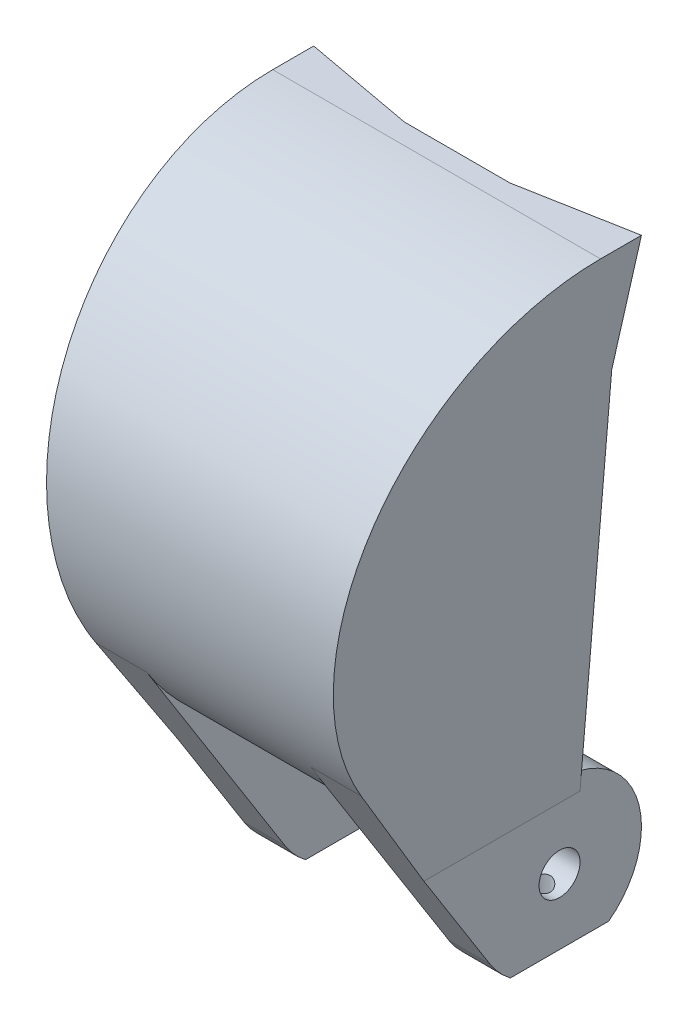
ISO-10303-21;
HEADER;
FILE_DESCRIPTION(('STEP AP214'),'2;1');
FILE_NAME('part.step','',(''),(''),'','','');
FILE_SCHEMA(('AUTOMOTIVE_DESIGN { 1 0 10303 214 1 1 1 1 }'));
ENDSEC;
DATA;
#1=APPLICATION_CONTEXT('core data for automotive mechanical design processes');
#2=APPLICATION_PROTOCOL_DEFINITION('international standard','automotive_design',2000,#1);
#3=PRODUCT_CONTEXT('',#1,'mechanical');
#4=PRODUCT('Part','Part','',(#3));
#5=PRODUCT_RELATED_PRODUCT_CATEGORY('part','',(#4));
#6=PRODUCT_DEFINITION_FORMATION('','',#4);
#7=PRODUCT_DEFINITION_CONTEXT('part definition',#1,'design');
#8=PRODUCT_DEFINITION('design','',#6,#7);
#9=PRODUCT_DEFINITION_SHAPE('','',#8);
#10=(LENGTH_UNIT() NAMED_UNIT(*) SI_UNIT(.MILLI.,.METRE.));
#11=(NAMED_UNIT(*) PLANE_ANGLE_UNIT() SI_UNIT($,.RADIAN.));
#12=(NAMED_UNIT(*) SI_UNIT($,.STERADIAN.) SOLID_ANGLE_UNIT());
#13=UNCERTAINTY_MEASURE_WITH_UNIT(LENGTH_MEASURE(1.E-05),#10,'distance_accuracy_value','');
#14=(GEOMETRIC_REPRESENTATION_CONTEXT(3) GLOBAL_UNCERTAINTY_ASSIGNED_CONTEXT((#13)) GLOBAL_UNIT_ASSIGNED_CONTEXT((#10,
#11,#12)) REPRESENTATION_CONTEXT('',''));
#15=CARTESIAN_POINT('',(0.,0.,0.));
#16=DIRECTION('',(0.,0.,1.));
#17=DIRECTION('',(1.,0.,0.));
#18=AXIS2_PLACEMENT_3D('',#15,#16,#17);
#19=CARTESIAN_POINT('',(-19.05,-9.525,0.));
#20=DIRECTION('',(1.,0.,0.));
#21=DIRECTION('',(0.,0.,-1.));
#22=AXIS2_PLACEMENT_3D('',#19,#20,#21);
#23=PLANE('',#22);
#24=CARTESIAN_POINT('',(-19.05,-9.525,0.));
#25=DIRECTION('',(-1.,0.,0.));
#26=DIRECTION('',(0.,0.,1.));
#27=AXIS2_PLACEMENT_3D('',#24,#25,#26);
#28=CIRCLE('',#27,3.175);
#29=CARTESIAN_POINT('',(-19.05,-9.525,3.17500000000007));
#30=VERTEX_POINT('',#29);
#31=EDGE_CURVE('E591',#30,#30,#28,.T.);
#32=ORIENTED_EDGE('',*,*,#31,.F.);
#33=EDGE_LOOP('',(#32));
#34=FACE_BOUND('',#33,.T.);
#35=DIRECTION('',(0.,-1.,0.));
#36=VECTOR('',#35,1.);
#37=CARTESIAN_POINT('',(-19.05,2.77172212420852,-3.175));
#38=LINE('',#37,#36);
#39=CARTESIAN_POINT('',(-19.05,2.77172212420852,-3.175));
#40=VERTEX_POINT('',#39);
#41=CARTESIAN_POINT('',(-19.05,0.,-3.175));
#42=VERTEX_POINT('',#41);
#43=EDGE_CURVE('E78',#40,#42,#38,.T.);
#44=ORIENTED_EDGE('',*,*,#43,.F.);
#45=CARTESIAN_POINT('',(-19.05,-9.525,0.));
#46=DIRECTION('',(1.,0.,0.));
#47=DIRECTION('',(0.,0.,-1.));
#48=AXIS2_PLACEMENT_3D('',#45,#46,#47);
#49=CIRCLE('',#48,12.7);
#50=CARTESIAN_POINT('',(-19.05,-19.685,-7.61999999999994));
#51=VERTEX_POINT('',#50);
#52=EDGE_CURVE('E274',#51,#40,#49,.T.);
#53=ORIENTED_EDGE('',*,*,#52,.F.);
#54=DIRECTION('',(0.,0.,-1.));
#55=VECTOR('',#54,1.);
#56=CARTESIAN_POINT('',(-19.05,-19.685,-7.9375));
#57=LINE('',#56,#55);
#58=CARTESIAN_POINT('',(-19.05,-19.685,7.62000000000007));
#59=VERTEX_POINT('',#58);
#60=EDGE_CURVE('E657',#59,#51,#57,.T.);
#61=ORIENTED_EDGE('',*,*,#60,.F.);
#62=CARTESIAN_POINT('',(-19.05,-16.2983333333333,10.742995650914));
#63=VERTEX_POINT('',#62);
#64=EDGE_CURVE('E441',#63,#59,#49,.T.);
#65=ORIENTED_EDGE('',*,*,#64,.F.);
#66=DIRECTION('',(0.,0.845905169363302,0.533333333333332));
#67=VECTOR('',#66,1.);
#68=CARTESIAN_POINT('',(-19.05,17.7800000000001,32.2289869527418));
#69=LINE('',#68,#67);
#70=CARTESIAN_POINT('',(-19.05,0.,21.0189045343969));
#71=VERTEX_POINT('',#70);
#72=EDGE_CURVE('E588',#63,#71,#69,.T.);
#73=ORIENTED_EDGE('',*,*,#72,.T.);
#74=DIRECTION('',(0.,0.,1.));
#75=VECTOR('',#74,1.);
#76=CARTESIAN_POINT('',(-19.05,0.,-3.175));
#77=LINE('',#76,#75);
#78=EDGE_CURVE('E677',#42,#71,#77,.T.);
#79=ORIENTED_EDGE('',*,*,#78,.F.);
#80=EDGE_LOOP('',(#44,#53,#61,#65,#73,#79));
#81=FACE_BOUND('',#80,.T.);
#82=ADVANCED_FACE('F57',(#34,#81),#23,.F.);
#83=CARTESIAN_POINT('',(-15.8859672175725,0.263669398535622,0.));
#84=DIRECTION('',(0.704664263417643,0.0587220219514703,-0.707106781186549));
#85=DIRECTION('',(-0.708329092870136,0.,-0.705882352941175));
#86=AXIS2_PLACEMENT_3D('',#83,#84,#85);
#87=PLANE('',#86);
#88=CARTESIAN_POINT('',(-15.0702447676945,-9.525,0.));
#89=DIRECTION('',(0.704664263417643,0.0587220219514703,-0.707106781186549));
#90=DIRECTION('',(-0.709540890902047,0.058318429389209,-0.702246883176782));
#91=AXIS2_PLACEMENT_3D('',#88,#89,#90);
#92=ELLIPSE('',#91,18.0227672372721,12.7);
#93=CARTESIAN_POINT('',(-19.2809768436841,2.77172212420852,-3.175));
#94=VERTEX_POINT('',#93);
#95=CARTESIAN_POINT('',(-16.1285781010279,3.17499999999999,0.));
#96=VERTEX_POINT('',#95);
#97=EDGE_CURVE('E242',#94,#96,#92,.T.);
#98=ORIENTED_EDGE('',*,*,#97,.F.);
#99=DIRECTION('',(-0.0830454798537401,0.99654575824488,0.));
#100=VECTOR('',#99,1.);
#101=CARTESIAN_POINT('',(-19.05,0.,-3.175));
#102=LINE('',#101,#100);
#103=CARTESIAN_POINT('',(-23.9672210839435,59.0066530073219,-3.175));
#104=VERTEX_POINT('',#103);
#105=EDGE_CURVE('E64',#94,#104,#102,.T.);
#106=ORIENTED_EDGE('',*,*,#105,.T.);
#107=DIRECTION('',(-0.704664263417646,-0.0587220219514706,-0.707106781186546));
#108=VECTOR('',#107,1.);
#109=CARTESIAN_POINT('',(-20.803188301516,59.2703224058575,0.));
#110=LINE('',#109,#108);
#111=CARTESIAN_POINT('',(-20.803188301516,59.2703224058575,0.));
#112=VERTEX_POINT('',#111);
#113=EDGE_CURVE('E265',#112,#104,#110,.T.);
#114=ORIENTED_EDGE('',*,*,#113,.F.);
#115=DIRECTION('',(0.08304547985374,-0.99654575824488,0.));
#116=VECTOR('',#115,1.);
#117=CARTESIAN_POINT('',(-15.8859672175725,0.263669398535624,0.));
#118=LINE('',#117,#116);
#119=CARTESIAN_POINT('',(-17.0990216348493,14.8203224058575,0.));
#120=VERTEX_POINT('',#119);
#121=EDGE_CURVE('E458',#112,#120,#118,.T.);
#122=ORIENTED_EDGE('',*,*,#121,.T.);
#123=DIRECTION('',(-0.0830454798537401,0.99654575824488,0.));
#124=VECTOR('',#123,1.);
#125=CARTESIAN_POINT('',(-15.8859672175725,0.263669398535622,0.));
#126=LINE('',#125,#124);
#127=EDGE_CURVE('E248',#96,#120,#126,.T.);
#128=ORIENTED_EDGE('',*,*,#127,.F.);
#129=EDGE_LOOP('',(#98,#106,#114,#122,#128));
#130=FACE_BOUND('',#129,.T.);
#131=ADVANCED_FACE('F244',(#130),#87,.T.);
#132=CARTESIAN_POINT('',(19.05,-9.525,0.));
#133=DIRECTION('',(1.,0.,0.));
#134=DIRECTION('',(0.,0.,-1.));
#135=AXIS2_PLACEMENT_3D('',#132,#133,#134);
#136=PLANE('',#135);
#137=CARTESIAN_POINT('',(19.05,-9.525,0.));
#138=DIRECTION('',(1.,0.,0.));
#139=DIRECTION('',(0.,0.,-1.));
#140=AXIS2_PLACEMENT_3D('',#137,#138,#139);
#141=CIRCLE('',#140,3.175);
#142=CARTESIAN_POINT('',(19.05,-9.525,-3.17499999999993));
#143=VERTEX_POINT('',#142);
#144=EDGE_CURVE('E473',#143,#143,#141,.F.);
#145=ORIENTED_EDGE('',*,*,#144,.T.);
#146=EDGE_LOOP('',(#145));
#147=FACE_BOUND('',#146,.T.);
#148=CARTESIAN_POINT('',(19.05,-9.525,0.));
#149=DIRECTION('',(1.,0.,0.));
#150=DIRECTION('',(0.,0.,-1.));
#151=AXIS2_PLACEMENT_3D('',#148,#149,#150);
#152=CIRCLE('',#151,12.7);
#153=CARTESIAN_POINT('',(19.05,-19.685,-7.61999999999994));
#154=VERTEX_POINT('',#153);
#155=CARTESIAN_POINT('',(19.05,2.77172212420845,-3.17500000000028));
#156=VERTEX_POINT('',#155);
#157=EDGE_CURVE('E438',#154,#156,#152,.T.);
#158=ORIENTED_EDGE('',*,*,#157,.T.);
#159=DIRECTION('',(0.,1.,0.));
#160=VECTOR('',#159,1.);
#161=CARTESIAN_POINT('',(19.05,0.,-3.175));
#162=LINE('',#161,#160);
#163=CARTESIAN_POINT('',(19.05,0.,-3.17499999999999));
#164=VERTEX_POINT('',#163);
#165=EDGE_CURVE('E275',#164,#156,#162,.T.);
#166=ORIENTED_EDGE('',*,*,#165,.F.);
#167=DIRECTION('',(0.,0.,1.));
#168=VECTOR('',#167,1.);
#169=CARTESIAN_POINT('',(19.05,0.,-3.175));
#170=LINE('',#169,#168);
#171=CARTESIAN_POINT('',(19.05,0.,21.0189045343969));
#172=VERTEX_POINT('',#171);
#173=EDGE_CURVE('E253',#164,#172,#170,.T.);
#174=ORIENTED_EDGE('',*,*,#173,.T.);
#175=DIRECTION('',(0.,-0.845905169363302,-0.533333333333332));
#176=VECTOR('',#175,1.);
#177=CARTESIAN_POINT('',(19.05,17.7800000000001,32.2289869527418));
#178=LINE('',#177,#176);
#179=CARTESIAN_POINT('',(19.05,-16.2983333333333,10.742995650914));
#180=VERTEX_POINT('',#179);
#181=EDGE_CURVE('E584',#172,#180,#178,.T.);
#182=ORIENTED_EDGE('',*,*,#181,.T.);
#183=CARTESIAN_POINT('',(19.05,-19.685,7.62000000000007));
#184=VERTEX_POINT('',#183);
#185=EDGE_CURVE('E440',#180,#184,#152,.T.);
#186=ORIENTED_EDGE('',*,*,#185,.T.);
#187=DIRECTION('',(0.,0.,1.));
#188=VECTOR('',#187,1.);
#189=CARTESIAN_POINT('',(19.05,-19.685,-7.9375));
#190=LINE('',#189,#188);
#191=EDGE_CURVE('E692',#154,#184,#190,.T.);
#192=ORIENTED_EDGE('',*,*,#191,.F.);
#193=EDGE_LOOP('',(#158,#166,#174,#182,#186,#192));
#194=FACE_BOUND('',#193,.T.);
#195=ADVANCED_FACE('F525',(#147,#194),#136,.T.);
#196=CARTESIAN_POINT('',(20.803188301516,59.2703224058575,0.));
#197=DIRECTION('',(-0.704664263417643,0.0587220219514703,-0.707106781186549));
#198=DIRECTION('',(-0.708329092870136,0.,0.705882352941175));
#199=AXIS2_PLACEMENT_3D('',#196,#197,#198);
#200=PLANE('',#199);
#201=DIRECTION('',(-0.0830454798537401,-0.99654575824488,0.));
#202=VECTOR('',#201,1.);
#203=CARTESIAN_POINT('',(23.9672210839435,59.0066530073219,-3.175));
#204=LINE('',#203,#202);
#205=CARTESIAN_POINT('',(23.970483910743,59.046413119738,-3.175));
#206=VERTEX_POINT('',#205);
#207=CARTESIAN_POINT('',(19.280976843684,2.77172212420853,-3.175));
#208=VERTEX_POINT('',#207);
#209=EDGE_CURVE('E687',#206,#208,#204,.T.);
#210=ORIENTED_EDGE('',*,*,#209,.T.);
#211=DIRECTION('',(0.690226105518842,-0.174211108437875,-0.702309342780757));
#212=VECTOR('',#211,1.);
#213=CARTESIAN_POINT('',(20.6864069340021,2.41699556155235,-4.60503383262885));
#214=LINE('',#213,#212);
#215=CARTESIAN_POINT('',(19.05,2.83002002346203,-2.9399796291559));
#216=VERTEX_POINT('',#215);
#217=EDGE_CURVE('E285',#216,#208,#214,.T.);
#218=ORIENTED_EDGE('',*,*,#217,.F.);
#219=CARTESIAN_POINT('',(15.0702447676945,-9.525,0.));
#220=DIRECTION('',(-0.704664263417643,0.0587220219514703,-0.707106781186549));
#221=DIRECTION('',(-0.709540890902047,-0.058318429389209,0.702246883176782));
#222=AXIS2_PLACEMENT_3D('',#219,#220,#221);
#223=ELLIPSE('',#222,18.0227672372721,12.7);
#224=CARTESIAN_POINT('',(16.1285781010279,3.17499999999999,0.));
#225=VERTEX_POINT('',#224);
#226=EDGE_CURVE('E252',#225,#216,#223,.T.);
#227=ORIENTED_EDGE('',*,*,#226,.F.);
#228=DIRECTION('',(-0.0830454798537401,-0.99654575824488,0.));
#229=VECTOR('',#228,1.);
#230=CARTESIAN_POINT('',(20.803188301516,59.2703224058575,0.));
#231=LINE('',#230,#229);
#232=CARTESIAN_POINT('',(17.0990216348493,14.8203224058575,0.));
#233=VERTEX_POINT('',#232);
#234=EDGE_CURVE('E686',#233,#225,#231,.T.);
#235=ORIENTED_EDGE('',*,*,#234,.F.);
#236=DIRECTION('',(0.08304547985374,0.99654575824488,0.));
#237=VECTOR('',#236,1.);
#238=CARTESIAN_POINT('',(15.8859672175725,0.263669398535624,0.));
#239=LINE('',#238,#237);
#240=CARTESIAN_POINT('',(20.803188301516,59.2703224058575,0.));
#241=VERTEX_POINT('',#240);
#242=EDGE_CURVE('E459',#233,#241,#239,.T.);
#243=ORIENTED_EDGE('',*,*,#242,.T.);
#244=DIRECTION('',(0.704664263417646,-0.0587220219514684,-0.707106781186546));
#245=VECTOR('',#244,1.);
#246=CARTESIAN_POINT('',(20.803188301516,59.2703224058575,0.));
#247=LINE('',#246,#245);
#248=EDGE_CURVE('E357',#241,#206,#247,.T.);
#249=ORIENTED_EDGE('',*,*,#248,.T.);
#250=EDGE_LOOP('',(#210,#218,#227,#235,#243,#249));
#251=FACE_BOUND('',#250,.T.);
#252=ADVANCED_FACE('F394',(#251),#200,.T.);
#253=CARTESIAN_POINT('',(25.4,38.1,0.));
#254=DIRECTION('',(-1.,0.,0.));
#255=DIRECTION('',(0.,0.,1.));
#256=AXIS2_PLACEMENT_3D('',#253,#254,#255);
#257=CYLINDRICAL_SURFACE('',#256,38.1);
#258=CARTESIAN_POINT('',(-22.225,38.1,0.));
#259=DIRECTION('',(0.99654575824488,0.08304547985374,0.));
#260=DIRECTION('',(-0.08304547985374,0.99654575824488,0.));
#261=AXIS2_PLACEMENT_3D('',#258,#259,#260);
#262=ELLIPSE('',#261,38.2320627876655,38.1);
#263=CARTESIAN_POINT('',(-25.4,76.2,0.));
#264=VERTEX_POINT('',#263);
#265=CARTESIAN_POINT('',(-20.5316666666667,17.7800000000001,32.2289869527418));
#266=VERTEX_POINT('',#265);
#267=EDGE_CURVE('E457',#264,#266,#262,.T.);
#268=ORIENTED_EDGE('',*,*,#267,.T.);
#269=DIRECTION('',(1.,0.,0.));
#270=VECTOR('',#269,1.);
#271=CARTESIAN_POINT('',(-65.9545882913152,17.7800000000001,32.2289869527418));
#272=LINE('',#271,#270);
#273=CARTESIAN_POINT('',(-12.7,17.7800000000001,32.2289869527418));
#274=VERTEX_POINT('',#273);
#275=EDGE_CURVE('E598',#266,#274,#272,.T.);
#276=ORIENTED_EDGE('',*,*,#275,.T.);
#277=CARTESIAN_POINT('',(-12.7,38.1,0.));
#278=DIRECTION('',(-1.,0.,0.));
#279=DIRECTION('',(0.,0.,-1.));
#280=AXIS2_PLACEMENT_3D('',#277,#278,#279);
#281=CIRCLE('',#280,38.1);
#282=CARTESIAN_POINT('',(-12.7,0.74083333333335,7.47680854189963));
#283=VERTEX_POINT('',#282);
#284=EDGE_CURVE('E579',#283,#274,#281,.T.);
#285=ORIENTED_EDGE('',*,*,#284,.F.);
#286=DIRECTION('',(1.,0.,0.));
#287=VECTOR('',#286,1.);
#288=CARTESIAN_POINT('',(-12.7,0.740833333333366,7.47680854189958));
#289=LINE('',#288,#287);
#290=CARTESIAN_POINT('',(12.7,0.74083333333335,7.47680854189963));
#291=VERTEX_POINT('',#290);
#292=EDGE_CURVE('E447',#283,#291,#289,.T.);
#293=ORIENTED_EDGE('',*,*,#292,.T.);
#294=CARTESIAN_POINT('',(12.7,38.1,0.));
#295=DIRECTION('',(-1.,0.,0.));
#296=DIRECTION('',(0.,0.,-1.));
#297=AXIS2_PLACEMENT_3D('',#294,#295,#296);
#298=CIRCLE('',#297,38.1);
#299=CARTESIAN_POINT('',(12.7,17.7800000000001,32.2289869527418));
#300=VERTEX_POINT('',#299);
#301=EDGE_CURVE('E585',#291,#300,#298,.T.);
#302=ORIENTED_EDGE('',*,*,#301,.T.);
#303=CARTESIAN_POINT('',(20.5316666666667,17.7800000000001,32.2289869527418));
#304=VERTEX_POINT('',#303);
#305=EDGE_CURVE('E594',#300,#304,#272,.T.);
#306=ORIENTED_EDGE('',*,*,#305,.T.);
#307=CARTESIAN_POINT('',(22.225,38.1,0.));
#308=DIRECTION('',(-0.99654575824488,0.08304547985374,0.));
#309=DIRECTION('',(-0.08304547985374,-0.99654575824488,0.));
#310=AXIS2_PLACEMENT_3D('',#307,#308,#309);
#311=ELLIPSE('',#310,38.2320627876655,38.1);
#312=CARTESIAN_POINT('',(25.4,76.2,0.));
#313=VERTEX_POINT('',#312);
#314=EDGE_CURVE('E464',#304,#313,#311,.T.);
#315=ORIENTED_EDGE('',*,*,#314,.T.);
#316=DIRECTION('',(-1.,0.,0.));
#317=VECTOR('',#316,1.);
#318=CARTESIAN_POINT('',(25.4,76.2,0.));
#319=LINE('',#318,#317);
#320=EDGE_CURVE('E466',#313,#264,#319,.T.);
#321=ORIENTED_EDGE('',*,*,#320,.T.);
#322=EDGE_LOOP('',(#268,#276,#285,#293,#302,#306,#315,#321));
#323=FACE_BOUND('',#322,.T.);
#324=ADVANCED_FACE('F498',(#323),#257,.T.);
#325=CARTESIAN_POINT('',(-12.7,3.17499999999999,0.));
#326=DIRECTION('',(0.,0.,1.));
#327=DIRECTION('',(1.,0.,0.));
#328=AXIS2_PLACEMENT_3D('',#325,#326,#327);
#329=PLANE('',#328);
#330=DIRECTION('',(-1.,0.,0.));
#331=VECTOR('',#330,1.);
#332=CARTESIAN_POINT('',(19.05,3.17499999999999,0.));
#333=LINE('',#332,#331);
#334=CARTESIAN_POINT('',(-12.7,3.17499999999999,0.));
#335=VERTEX_POINT('',#334);
#336=EDGE_CURVE('E453',#96,#335,#333,.F.);
#337=ORIENTED_EDGE('',*,*,#336,.F.);
#338=ORIENTED_EDGE('',*,*,#127,.T.);
#339=CARTESIAN_POINT('',(-4.44289050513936,15.875,0.));
#340=DIRECTION('',(0.,0.,1.));
#341=DIRECTION('',(1.,0.,0.));
#342=AXIS2_PLACEMENT_3D('',#339,#340,#341);
#343=CIRCLE('',#342,12.7);
#344=CARTESIAN_POINT('',(-4.44289050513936,3.17499999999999,0.));
#345=VERTEX_POINT('',#344);
#346=EDGE_CURVE('E70',#120,#345,#343,.T.);
#347=ORIENTED_EDGE('',*,*,#346,.T.);
#348=DIRECTION('',(1.,0.,0.));
#349=VECTOR('',#348,1.);
#350=CARTESIAN_POINT('',(-12.7,3.17499999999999,0.));
#351=LINE('',#350,#349);
#352=CARTESIAN_POINT('',(4.4428917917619,3.17499999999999,0.));
#353=VERTEX_POINT('',#352);
#354=EDGE_CURVE('E628',#345,#353,#351,.T.);
#355=ORIENTED_EDGE('',*,*,#354,.T.);
#356=CARTESIAN_POINT('',(4.44289050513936,15.875,0.));
#357=DIRECTION('',(0.,0.,1.));
#358=DIRECTION('',(1.,0.,0.));
#359=AXIS2_PLACEMENT_3D('',#356,#357,#358);
#360=CIRCLE('',#359,12.7);
#361=EDGE_CURVE('E486',#353,#233,#360,.T.);
#362=ORIENTED_EDGE('',*,*,#361,.T.);
#363=ORIENTED_EDGE('',*,*,#234,.T.);
#364=CARTESIAN_POINT('',(12.7,3.17499999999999,0.));
#365=VERTEX_POINT('',#364);
#366=EDGE_CURVE('E446',#365,#225,#333,.F.);
#367=ORIENTED_EDGE('',*,*,#366,.F.);
#368=DIRECTION('',(0.,-1.,0.));
#369=VECTOR('',#368,1.);
#370=CARTESIAN_POINT('',(12.7,3.17499999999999,0.));
#371=LINE('',#370,#369);
#372=CARTESIAN_POINT('',(12.7,0.,0.));
#373=VERTEX_POINT('',#372);
#374=EDGE_CURVE('E614',#365,#373,#371,.T.);
#375=ORIENTED_EDGE('',*,*,#374,.T.);
#376=DIRECTION('',(1.,0.,0.));
#377=VECTOR('',#376,1.);
#378=CARTESIAN_POINT('',(-12.7,0.,0.));
#379=LINE('',#378,#377);
#380=CARTESIAN_POINT('',(-12.7,0.,0.));
#381=VERTEX_POINT('',#380);
#382=EDGE_CURVE('E627',#381,#373,#379,.T.);
#383=ORIENTED_EDGE('',*,*,#382,.F.);
#384=DIRECTION('',(0.,-1.,0.));
#385=VECTOR('',#384,1.);
#386=CARTESIAN_POINT('',(-12.7,3.17499999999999,0.));
#387=LINE('',#386,#385);
#388=EDGE_CURVE('E624',#335,#381,#387,.T.);
#389=ORIENTED_EDGE('',*,*,#388,.F.);
#390=EDGE_LOOP('',(#337,#338,#347,#355,#362,#363,#367,#375,#383,#389));
#391=FACE_BOUND('',#390,.T.);
#392=ADVANCED_FACE('F513',(#391),#329,.F.);
#393=CARTESIAN_POINT('',(19.05,-9.525,0.));
#394=DIRECTION('',(-1.,0.,0.));
#395=DIRECTION('',(0.,0.,1.));
#396=AXIS2_PLACEMENT_3D('',#393,#394,#395);
#397=CYLINDRICAL_SURFACE('',#396,12.7);
#398=ORIENTED_EDGE('',*,*,#64,.T.);
#399=DIRECTION('',(-1.,0.,0.));
#400=VECTOR('',#399,1.);
#401=CARTESIAN_POINT('',(19.05,-19.685,7.62000000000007));
#402=LINE('',#401,#400);
#403=CARTESIAN_POINT('',(-12.7,-19.685,7.62000000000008));
#404=VERTEX_POINT('',#403);
#405=EDGE_CURVE('E655',#59,#404,#402,.F.);
#406=ORIENTED_EDGE('',*,*,#405,.T.);
#407=CARTESIAN_POINT('',(-12.7,-9.525,0.));
#408=DIRECTION('',(1.,0.,0.));
#409=DIRECTION('',(0.,0.,-1.));
#410=AXIS2_PLACEMENT_3D('',#407,#408,#409);
#411=CIRCLE('',#410,12.7);
#412=CARTESIAN_POINT('',(-12.7,-16.2983333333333,10.742995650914));
#413=VERTEX_POINT('',#412);
#414=EDGE_CURVE('E621',#413,#404,#411,.T.);
#415=ORIENTED_EDGE('',*,*,#414,.F.);
#416=DIRECTION('',(1.,0.,0.));
#417=VECTOR('',#416,1.);
#418=CARTESIAN_POINT('',(-65.9545882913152,-16.2983333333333,10.742995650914));
#419=LINE('',#418,#417);
#420=EDGE_CURVE('E592',#63,#413,#419,.T.);
#421=ORIENTED_EDGE('',*,*,#420,.F.);
#422=EDGE_LOOP('',(#398,#406,#415,#421));
#423=FACE_BOUND('',#422,.T.);
#424=ADVANCED_FACE('F507',(#423),#397,.T.);
#425=DIRECTION('',(-1.,0.,0.));
#426=VECTOR('',#425,1.);
#427=CARTESIAN_POINT('',(19.05,-19.685,7.62000000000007));
#428=LINE('',#427,#426);
#429=CARTESIAN_POINT('',(12.7,-19.685,7.62000000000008));
#430=VERTEX_POINT('',#429);
#431=EDGE_CURVE('E652',#184,#430,#428,.T.);
#432=ORIENTED_EDGE('',*,*,#431,.F.);
#433=ORIENTED_EDGE('',*,*,#185,.F.);
#434=CARTESIAN_POINT('',(12.7,-16.2983333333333,10.742995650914));
#435=VERTEX_POINT('',#434);
#436=EDGE_CURVE('E597',#435,#180,#419,.T.);
#437=ORIENTED_EDGE('',*,*,#436,.F.);
#438=CARTESIAN_POINT('',(12.7,-9.525,0.));
#439=DIRECTION('',(1.,0.,0.));
#440=DIRECTION('',(0.,0.,-1.));
#441=AXIS2_PLACEMENT_3D('',#438,#439,#440);
#442=CIRCLE('',#441,12.7);
#443=EDGE_CURVE('E611',#435,#430,#442,.T.);
#444=ORIENTED_EDGE('',*,*,#443,.T.);
#445=EDGE_LOOP('',(#432,#433,#437,#444));
#446=FACE_BOUND('',#445,.T.);
#447=ADVANCED_FACE('F512',(#446),#397,.T.);
#448=ORIENTED_EDGE('',*,*,#366,.T.);
#449=ORIENTED_EDGE('',*,*,#226,.T.);
#450=CARTESIAN_POINT('',(19.05,2.77172212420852,-3.175));
#451=DIRECTION('',(0.,0.240758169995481,0.970585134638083));
#452=VECTOR('',#451,1.);
#453=LINE('',#450,#452);
#454=EDGE_CURVE('E86',#156,#216,#453,.T.);
#455=ORIENTED_EDGE('',*,*,#454,.F.);
#456=ORIENTED_EDGE('',*,*,#157,.F.);
#457=DIRECTION('',(-1.,0.,0.));
#458=VECTOR('',#457,1.);
#459=CARTESIAN_POINT('',(19.05,-19.685,-7.61999999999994));
#460=LINE('',#459,#458);
#461=CARTESIAN_POINT('',(12.7,-19.685,-7.61999999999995));
#462=VERTEX_POINT('',#461);
#463=EDGE_CURVE('E649',#462,#154,#460,.F.);
#464=ORIENTED_EDGE('',*,*,#463,.F.);
#465=EDGE_CURVE('E610',#462,#365,#442,.T.);
#466=ORIENTED_EDGE('',*,*,#465,.T.);
#467=EDGE_LOOP('',(#448,#449,#455,#456,#464,#466));
#468=FACE_BOUND('',#467,.T.);
#469=ADVANCED_FACE('F546',(#468),#397,.T.);
#470=CARTESIAN_POINT('',(12.7,-9.525,0.));
#471=DIRECTION('',(1.,0.,0.));
#472=DIRECTION('',(0.,0.,-1.));
#473=AXIS2_PLACEMENT_3D('',#470,#471,#472);
#474=PLANE('',#473);
#475=CARTESIAN_POINT('',(12.7,-9.525,0.));
#476=DIRECTION('',(1.,0.,0.));
#477=DIRECTION('',(0.,0.,-1.));
#478=AXIS2_PLACEMENT_3D('',#475,#476,#477);
#479=CIRCLE('',#478,3.175);
#480=CARTESIAN_POINT('',(12.7,-9.525,-3.17499999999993));
#481=VERTEX_POINT('',#480);
#482=EDGE_CURVE('E469',#481,#481,#479,.T.);
#483=ORIENTED_EDGE('',*,*,#482,.T.);
#484=EDGE_LOOP('',(#483));
#485=FACE_BOUND('',#484,.T.);
#486=DIRECTION('',(0.,0.,-1.));
#487=VECTOR('',#486,1.);
#488=CARTESIAN_POINT('',(12.7,-19.685,-7.9375));
#489=LINE('',#488,#487);
#490=EDGE_CURVE('E646',#430,#462,#489,.T.);
#491=ORIENTED_EDGE('',*,*,#490,.F.);
#492=ORIENTED_EDGE('',*,*,#443,.F.);
#493=DIRECTION('',(0.,-0.845905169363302,-0.533333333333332));
#494=VECTOR('',#493,1.);
#495=CARTESIAN_POINT('',(12.7,17.7800000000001,32.2289869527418));
#496=LINE('',#495,#494);
#497=EDGE_CURVE('E582',#300,#435,#496,.T.);
#498=ORIENTED_EDGE('',*,*,#497,.F.);
#499=ORIENTED_EDGE('',*,*,#301,.F.);
#500=DIRECTION('',(0.,0.0986013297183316,0.995127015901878));
#501=VECTOR('',#500,1.);
#502=CARTESIAN_POINT('',(12.7,0.,0.));
#503=LINE('',#502,#501);
#504=EDGE_CURVE('E607',#373,#291,#503,.T.);
#505=ORIENTED_EDGE('',*,*,#504,.F.);
#506=ORIENTED_EDGE('',*,*,#374,.F.);
#507=ORIENTED_EDGE('',*,*,#465,.F.);
#508=EDGE_LOOP('',(#491,#492,#498,#499,#505,#506,#507));
#509=FACE_BOUND('',#508,.T.);
#510=ADVANCED_FACE('F542',(#485,#509),#474,.F.);
#511=CARTESIAN_POINT('',(15.875,76.201,0.));
#512=DIRECTION('',(0.,-1.,0.));
#513=DIRECTION('',(0.,0.,-1.));
#514=AXIS2_PLACEMENT_3D('',#511,#512,#513);
#515=CYLINDRICAL_SURFACE('',#514,1.7272);
#516=CARTESIAN_POINT('',(15.875,-12.1890955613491,-1.72719999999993));
#517=CARTESIAN_POINT('',(15.786294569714,-12.1891048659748,-1.72719323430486));
#518=CARTESIAN_POINT('',(15.6975070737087,-12.1935957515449,-1.72031913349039));
#519=CARTESIAN_POINT('',(15.5227625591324,-12.2108635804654,-1.69322231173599));
#520=CARTESIAN_POINT('',(15.4368107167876,-12.2236548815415,-1.67297645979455));
#521=CARTESIAN_POINT('',(15.2706118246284,-12.2555797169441,-1.62033673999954));
#522=CARTESIAN_POINT('',(15.1903333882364,-12.2746743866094,-1.58801715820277));
#523=CARTESIAN_POINT('',(15.0363667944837,-12.3169916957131,-1.51237588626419));
#524=CARTESIAN_POINT('',(14.9626799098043,-12.3402151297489,-1.46905207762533));
#525=CARTESIAN_POINT('',(14.8159807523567,-12.3909605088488,-1.36763098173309));
#526=CARTESIAN_POINT('',(14.7437530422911,-12.4186804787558,-1.308497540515));
#527=CARTESIAN_POINT('',(14.6096129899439,-12.4737055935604,-1.17927756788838));
#528=CARTESIAN_POINT('',(14.5477066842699,-12.501010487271,-1.10918467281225));
#529=CARTESIAN_POINT('',(14.4308837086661,-12.5548461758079,-0.952908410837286));
#530=CARTESIAN_POINT('',(14.3769816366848,-12.581122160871,-0.865870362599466));
#531=CARTESIAN_POINT('',(14.2849499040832,-12.6272694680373,-0.682261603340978));
#532=CARTESIAN_POINT('',(14.2468084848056,-12.6471455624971,-0.585698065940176));
#533=CARTESIAN_POINT('',(14.19065716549,-12.6768085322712,-0.394132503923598));
#534=CARTESIAN_POINT('',(14.1712568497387,-12.6872871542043,-0.299647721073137));
#535=CARTESIAN_POINT('',(14.1485081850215,-12.6995995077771,-0.108233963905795));
#536=CARTESIAN_POINT('',(14.1451479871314,-12.7014396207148,-0.0113068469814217));
#537=CARTESIAN_POINT('',(14.1541578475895,-12.6965450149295,0.171568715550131));
#538=CARTESIAN_POINT('',(14.1649508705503,-12.6906698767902,0.257624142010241));
#539=CARTESIAN_POINT('',(14.1990658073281,-12.6723724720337,0.426478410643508));
#540=CARTESIAN_POINT('',(14.2223886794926,-12.6599497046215,0.509277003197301));
#541=CARTESIAN_POINT('',(14.2809220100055,-12.62949034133,0.67050642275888));
#542=CARTESIAN_POINT('',(14.3162630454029,-12.6113922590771,0.74887774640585));
#543=CARTESIAN_POINT('',(14.3975800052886,-12.5711332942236,0.898735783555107));
#544=CARTESIAN_POINT('',(14.4435593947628,-12.5489710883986,0.970220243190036));
#545=CARTESIAN_POINT('',(14.5504216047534,-12.4997986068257,1.11240296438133));
#546=CARTESIAN_POINT('',(14.6123692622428,-12.4725234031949,1.18220941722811));
#547=CARTESIAN_POINT('',(14.746614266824,-12.4175605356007,1.31096518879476));
#548=CARTESIAN_POINT('',(14.8189219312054,-12.3898724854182,1.36990354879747));
#549=CARTESIAN_POINT('',(14.9792236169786,-12.3345719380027,1.48022020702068));
#550=CARTESIAN_POINT('',(15.0680274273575,-12.307164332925,1.5305358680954));
#551=CARTESIAN_POINT('',(15.254590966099,-12.2589066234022,1.61516932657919));
#552=CARTESIAN_POINT('',(15.3523402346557,-12.2380489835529,1.6495055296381));
#553=CARTESIAN_POINT('',(15.545845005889,-12.2077957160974,1.69823451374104));
#554=CARTESIAN_POINT('',(15.641120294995,-12.1976082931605,1.71401782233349));
#555=CARTESIAN_POINT('',(15.8334680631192,-12.1876960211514,1.72938570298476));
#556=CARTESIAN_POINT('',(15.9305384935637,-12.1879599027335,1.72898772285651));
#557=CARTESIAN_POINT('',(16.1090518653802,-12.198079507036,1.71327799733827));
#558=CARTESIAN_POINT('',(16.1907721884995,-12.2065806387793,1.7000721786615));
#559=CARTESIAN_POINT('',(16.35061822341,-12.2300620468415,1.66245374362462));
#560=CARTESIAN_POINT('',(16.4287424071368,-12.2450450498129,1.6380364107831));
#561=CARTESIAN_POINT('',(16.5830816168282,-12.2805196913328,1.57765825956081));
#562=CARTESIAN_POINT('',(16.6590699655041,-12.3012205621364,1.5412460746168));
#563=CARTESIAN_POINT('',(16.8043130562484,-12.3456805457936,1.45828688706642));
#564=CARTESIAN_POINT('',(16.8735644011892,-12.3694411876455,1.41173480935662));
#565=CARTESIAN_POINT('',(17.0145703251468,-12.4217391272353,1.30145944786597));
#566=CARTESIAN_POINT('',(17.0850617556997,-12.4504476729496,1.23619488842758));
#567=CARTESIAN_POINT('',(17.2145843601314,-12.5063548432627,1.09450973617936));
#568=CARTESIAN_POINT('',(17.2736091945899,-12.5335526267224,1.01808301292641));
#569=CARTESIAN_POINT('',(17.3810880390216,-12.5849629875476,0.851578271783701));
#570=CARTESIAN_POINT('',(17.4289113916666,-12.6089739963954,0.761026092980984));
#571=CARTESIAN_POINT('',(17.5081388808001,-12.6496417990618,0.571486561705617));
#572=CARTESIAN_POINT('',(17.5395597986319,-12.6663061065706,0.472507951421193));
#573=CARTESIAN_POINT('',(17.5819696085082,-12.688995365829,0.279674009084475));
#574=CARTESIAN_POINT('',(17.5946990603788,-12.6959235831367,0.186308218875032));
#575=CARTESIAN_POINT('',(17.6047526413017,-12.7013859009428,-0.00147767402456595));
#576=CARTESIAN_POINT('',(17.6020844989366,-12.6999242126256,-0.0958972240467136));
#577=CARTESIAN_POINT('',(17.5824150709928,-12.6892717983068,-0.274447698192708));
#578=CARTESIAN_POINT('',(17.5666712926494,-12.6807593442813,-0.358763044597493));
#579=CARTESIAN_POINT('',(17.5232001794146,-12.657671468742,-0.523358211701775));
#580=CARTESIAN_POINT('',(17.4954713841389,-12.6430953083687,-0.603637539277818));
#581=CARTESIAN_POINT('',(17.4278915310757,-12.6085054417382,-0.761154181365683));
#582=CARTESIAN_POINT('',(17.3876447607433,-12.5883169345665,-0.838182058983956));
#583=CARTESIAN_POINT('',(17.2966603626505,-12.5444264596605,-0.984654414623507));
#584=CARTESIAN_POINT('',(17.2459183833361,-12.5207230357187,-1.05409572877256));
#585=CARTESIAN_POINT('',(17.1287795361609,-12.4688583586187,-1.19177481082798));
#586=CARTESIAN_POINT('',(17.0612599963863,-12.4404963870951,-1.25898340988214));
#587=CARTESIAN_POINT('',(16.9158732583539,-12.3844272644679,-1.38161440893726));
#588=CARTESIAN_POINT('',(16.8379940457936,-12.3567209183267,-1.43702292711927));
#589=CARTESIAN_POINT('',(16.6681015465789,-12.3034010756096,-1.53771116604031));
#590=CARTESIAN_POINT('',(16.5755121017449,-12.2780228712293,-1.58215288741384));
#591=CARTESIAN_POINT('',(16.3823935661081,-12.2353694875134,-1.65417893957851));
#592=CARTESIAN_POINT('',(16.2818912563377,-12.2180682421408,-1.68181758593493));
#593=CARTESIAN_POINT('',(16.1292258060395,-12.2007319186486,-1.70914665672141));
#594=CARTESIAN_POINT('',(16.0787264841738,-12.1963925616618,-1.71590078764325));
#595=CARTESIAN_POINT('',(15.9771605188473,-12.1905716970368,-1.7249294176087));
#596=CARTESIAN_POINT('',(15.9260938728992,-12.1890902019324,-1.7272038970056));
#597=CARTESIAN_POINT('',(15.875,-12.1890955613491,-1.72719999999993));
#598=B_SPLINE_CURVE_WITH_KNOTS('',3,(#516,#517,#518,#519,#520,#521,#522,#523,#524,#525,#526,
#527,#528,#529,#530,#531,#532,#533,#534,#535,#536,#537,#538,#539,#540,#541,#542,#543,#544,#545,
#546,#547,#548,#549,#550,#551,#552,#553,#554,#555,#556,#557,#558,#559,#560,#561,#562,#563,#564,
#565,#566,#567,#568,#569,#570,#571,#572,#573,#574,#575,#576,#577,#578,#579,#580,#581,#582,#583,
#584,#585,#586,#587,#588,#589,#590,#591,#592,#593,#594,#595,#596,#597),.UNSPECIFIED.,.T.,.F.,(4,
2,2,2,2,2,2,2,2,2,2,2,2,2,2,2,2,2,2,2,2,2,2,2,2,2,2,2,2,2,2,2,2,2,2,2,2,2,2,2,4),(0.,
0.265899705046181,0.532260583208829,0.797008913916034,1.06180825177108,1.35274578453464,
1.64385288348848,1.95925628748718,2.27442394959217,2.56383650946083,2.85303524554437,
3.11259135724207,3.37216732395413,3.63465880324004,3.89723589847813,4.18773288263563,
4.47852120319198,4.79393052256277,5.10897563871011,5.39849355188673,5.68769929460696,
5.93621992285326,6.18484519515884,6.44416515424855,6.70361520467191,7.00310702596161,
7.30276395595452,7.61656871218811,7.9300517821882,8.21192979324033,8.49366633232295,
8.75107595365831,9.00851694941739,9.27510514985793,9.54180410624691,9.8387420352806,
10.1360273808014,10.4516923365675,10.7663314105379,10.9194876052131,11.072644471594),.UNSPECIFIED.);
#599=CARTESIAN_POINT('',(15.875,-12.1890955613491,-1.72719999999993));
#600=VERTEX_POINT('',#599);
#601=EDGE_CURVE('E572',#600,#600,#598,.T.);
#602=ORIENTED_EDGE('',*,*,#601,.T.);
#603=EDGE_LOOP('',(#602));
#604=FACE_BOUND('',#603,.T.);
#605=CARTESIAN_POINT('',(15.875,-19.685,0.));
#606=DIRECTION('',(0.,-1.,0.));
#607=DIRECTION('',(0.,0.,1.));
#608=AXIS2_PLACEMENT_3D('',#605,#606,#607);
#609=CIRCLE('',#608,1.7272);
#610=CARTESIAN_POINT('',(15.875,-19.685,1.7272));
#611=VERTEX_POINT('',#610);
#612=EDGE_CURVE('E435',#611,#611,#609,.T.);
#613=ORIENTED_EDGE('',*,*,#612,.T.);
#614=EDGE_LOOP('',(#613));
#615=FACE_BOUND('',#614,.T.);
#616=ADVANCED_FACE('F545',(#604,#615),#515,.F.);
#617=CARTESIAN_POINT('',(-65.9545882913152,17.7800000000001,32.2289869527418));
#618=DIRECTION('',(0.,-0.533333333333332,0.845905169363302));
#619=DIRECTION('',(0.,-0.845905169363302,-0.533333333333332));
#620=AXIS2_PLACEMENT_3D('',#617,#618,#619);
#621=PLANE('',#620);
#622=ORIENTED_EDGE('',*,*,#420,.T.);
#623=DIRECTION('',(0.,-0.845905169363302,-0.533333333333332));
#624=VECTOR('',#623,1.);
#625=CARTESIAN_POINT('',(-12.7,17.7800000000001,32.2289869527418));
#626=LINE('',#625,#624);
#627=EDGE_CURVE('E581',#274,#413,#626,.T.);
#628=ORIENTED_EDGE('',*,*,#627,.F.);
#629=ORIENTED_EDGE('',*,*,#275,.F.);
#630=DIRECTION('',(0.0703176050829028,-0.843811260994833,-0.532013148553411));
#631=VECTOR('',#630,1.);
#632=CARTESIAN_POINT('',(-19.2359785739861,2.23174288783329,22.4259923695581));
#633=LINE('',#632,#631);
#634=EDGE_CURVE('E284',#266,#71,#633,.T.);
#635=ORIENTED_EDGE('',*,*,#634,.T.);
#636=ORIENTED_EDGE('',*,*,#72,.F.);
#637=EDGE_LOOP('',(#622,#628,#629,#635,#636));
#638=FACE_BOUND('',#637,.T.);
#639=ADVANCED_FACE('F555',(#638),#621,.T.);
#640=ORIENTED_EDGE('',*,*,#52,.T.);
#641=DIRECTION('',(1.,0.,0.));
#642=VECTOR('',#641,1.);
#643=CARTESIAN_POINT('',(-22.4848561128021,2.77172212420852,-3.175));
#644=LINE('',#643,#642);
#645=EDGE_CURVE('E269',#94,#40,#644,.T.);
#646=ORIENTED_EDGE('',*,*,#645,.F.);
#647=ORIENTED_EDGE('',*,*,#97,.T.);
#648=ORIENTED_EDGE('',*,*,#336,.T.);
#649=CARTESIAN_POINT('',(-12.7,-19.685,-7.61999999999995));
#650=VERTEX_POINT('',#649);
#651=EDGE_CURVE('E620',#650,#335,#411,.T.);
#652=ORIENTED_EDGE('',*,*,#651,.F.);
#653=DIRECTION('',(-1.,0.,0.));
#654=VECTOR('',#653,1.);
#655=CARTESIAN_POINT('',(19.05,-19.685,-7.61999999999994));
#656=LINE('',#655,#654);
#657=EDGE_CURVE('E573',#650,#51,#656,.T.);
#658=ORIENTED_EDGE('',*,*,#657,.T.);
#659=EDGE_LOOP('',(#640,#646,#647,#648,#652,#658));
#660=FACE_BOUND('',#659,.T.);
#661=ADVANCED_FACE('F272',(#660),#397,.T.);
#662=CARTESIAN_POINT('',(19.05,0.,38.1));
#663=DIRECTION('',(-0.99654575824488,0.08304547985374,0.));
#664=DIRECTION('',(-0.08304547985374,-0.99654575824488,0.));
#665=AXIS2_PLACEMENT_3D('',#662,#663,#664);
#666=PLANE('',#665);
#667=DIRECTION('',(0.,0.,1.));
#668=VECTOR('',#667,1.);
#669=CARTESIAN_POINT('',(25.4,76.2,-3.175));
#670=LINE('',#669,#668);
#671=CARTESIAN_POINT('',(25.4,76.2,-3.175));
#672=VERTEX_POINT('',#671);
#673=EDGE_CURVE('E682',#672,#313,#670,.T.);
#674=ORIENTED_EDGE('',*,*,#673,.T.);
#675=ORIENTED_EDGE('',*,*,#314,.F.);
#676=DIRECTION('',(0.0703176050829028,0.843811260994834,0.532013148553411));
#677=VECTOR('',#676,1.);
#678=CARTESIAN_POINT('',(20.7103190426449,19.9238285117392,33.5806458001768));
#679=LINE('',#678,#677);
#680=EDGE_CURVE('E332',#172,#304,#679,.T.);
#681=ORIENTED_EDGE('',*,*,#680,.F.);
#682=ORIENTED_EDGE('',*,*,#173,.F.);
#683=DIRECTION('',(-0.0830454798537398,-0.99654575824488,0.));
#684=VECTOR('',#683,1.);
#685=CARTESIAN_POINT('',(19.0736886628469,0.284263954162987,-3.175));
#686=LINE('',#685,#684);
#687=EDGE_CURVE('E281',#208,#164,#686,.T.);
#688=ORIENTED_EDGE('',*,*,#687,.F.);
#689=ORIENTED_EDGE('',*,*,#209,.F.);
#690=DIRECTION('',(0.0816740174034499,0.9800882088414,-0.180987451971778));
#691=VECTOR('',#690,1.);
#692=CARTESIAN_POINT('',(24.6836105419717,67.6033265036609,-4.7625));
#693=LINE('',#692,#691);
#694=CARTESIAN_POINT('',(25.4,76.2,-6.35));
#695=VERTEX_POINT('',#694);
#696=EDGE_CURVE('E427',#206,#695,#693,.T.);
#697=ORIENTED_EDGE('',*,*,#696,.T.);
#698=DIRECTION('',(0.,0.,1.));
#699=VECTOR('',#698,1.);
#700=CARTESIAN_POINT('',(25.4,76.2,-6.35));
#701=LINE('',#700,#699);
#702=EDGE_CURVE('E415',#695,#672,#701,.T.);
#703=ORIENTED_EDGE('',*,*,#702,.T.);
#704=EDGE_LOOP('',(#674,#675,#681,#682,#688,#689,#697,#703));
#705=FACE_BOUND('',#704,.T.);
#706=ADVANCED_FACE('F706',(#705),#666,.F.);
#707=CARTESIAN_POINT('',(-19.05,0.,38.1));
#708=DIRECTION('',(0.99654575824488,0.08304547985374,0.));
#709=DIRECTION('',(-0.08304547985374,0.99654575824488,0.));
#710=AXIS2_PLACEMENT_3D('',#707,#708,#709);
#711=PLANE('',#710);
#712=ORIENTED_EDGE('',*,*,#267,.F.);
#713=DIRECTION('',(0.,0.,1.));
#714=VECTOR('',#713,1.);
#715=CARTESIAN_POINT('',(-25.4,76.2,-3.175));
#716=LINE('',#715,#714);
#717=CARTESIAN_POINT('',(-25.4,76.2,-6.35));
#718=VERTEX_POINT('',#717);
#719=EDGE_CURVE('E678',#718,#264,#716,.T.);
#720=ORIENTED_EDGE('',*,*,#719,.F.);
#721=DIRECTION('',(-0.0816740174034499,0.9800882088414,-0.180987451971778));
#722=VECTOR('',#721,1.);
#723=CARTESIAN_POINT('',(-24.6836105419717,67.6033265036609,-4.7625));
#724=LINE('',#723,#722);
#725=EDGE_CURVE('E263',#104,#718,#724,.T.);
#726=ORIENTED_EDGE('',*,*,#725,.F.);
#727=ORIENTED_EDGE('',*,*,#105,.F.);
#728=EDGE_CURVE('E261',#42,#94,#102,.T.);
#729=ORIENTED_EDGE('',*,*,#728,.F.);
#730=ORIENTED_EDGE('',*,*,#78,.T.);
#731=ORIENTED_EDGE('',*,*,#634,.F.);
#732=EDGE_LOOP('',(#712,#720,#726,#727,#729,#730,#731));
#733=FACE_BOUND('',#732,.T.);
#734=ADVANCED_FACE('F260',(#733),#711,.F.);
#735=CARTESIAN_POINT('',(25.4,38.1,0.));
#736=DIRECTION('',(-1.,0.,0.));
#737=DIRECTION('',(0.,0.,1.));
#738=AXIS2_PLACEMENT_3D('',#735,#736,#737);
#739=CYLINDRICAL_SURFACE('',#738,34.925);
#740=DIRECTION('',(-1.,0.,0.));
#741=VECTOR('',#740,1.);
#742=CARTESIAN_POINT('',(21.9494114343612,73.025,0.));
#743=LINE('',#742,#741);
#744=CARTESIAN_POINT('',(8.14705717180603,73.025,0.));
#745=VERTEX_POINT('',#744);
#746=CARTESIAN_POINT('',(-8.14705717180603,73.025,0.));
#747=VERTEX_POINT('',#746);
#748=EDGE_CURVE('E454',#745,#747,#743,.T.);
#749=ORIENTED_EDGE('',*,*,#748,.F.);
#750=CARTESIAN_POINT('',(6.29497383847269,38.1,0.));
#751=DIRECTION('',(0.998596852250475,-0.0529558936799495,0.));
#752=DIRECTION('',(-0.0529558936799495,-0.998596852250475,0.));
#753=AXIS2_PLACEMENT_3D('',#750,#751,#752);
#754=ELLIPSE('',#753,34.9740737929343,34.925);
#755=EDGE_CURVE('E478',#745,#353,#754,.T.);
#756=ORIENTED_EDGE('',*,*,#755,.T.);
#757=ORIENTED_EDGE('',*,*,#354,.F.);
#758=CARTESIAN_POINT('',(-6.2949738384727,38.1,0.));
#759=DIRECTION('',(-0.998596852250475,-0.0529558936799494,0.));
#760=DIRECTION('',(-0.0529558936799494,0.998596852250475,0.));
#761=AXIS2_PLACEMENT_3D('',#758,#759,#760);
#762=ELLIPSE('',#761,34.9740737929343,34.925);
#763=EDGE_CURVE('E476',#345,#747,#762,.T.);
#764=ORIENTED_EDGE('',*,*,#763,.T.);
#765=EDGE_LOOP('',(#749,#756,#757,#764));
#766=FACE_BOUND('',#765,.T.);
#767=ADVANCED_FACE('F502',(#766),#739,.F.);
#768=CARTESIAN_POINT('',(15.8859672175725,0.263669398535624,38.1));
#769=DIRECTION('',(-0.99654575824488,0.08304547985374,0.));
#770=DIRECTION('',(-0.08304547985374,-0.99654575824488,0.));
#771=AXIS2_PLACEMENT_3D('',#768,#769,#770);
#772=PLANE('',#771);
#773=ORIENTED_EDGE('',*,*,#242,.F.);
#774=CARTESIAN_POINT('',(18.9511049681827,37.0453224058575,0.));
#775=DIRECTION('',(-0.99654575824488,0.08304547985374,0.));
#776=DIRECTION('',(-0.08304547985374,-0.99654575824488,0.));
#777=AXIS2_PLACEMENT_3D('',#774,#775,#776);
#778=ELLIPSE('',#777,22.3020366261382,22.225);
#779=EDGE_CURVE('E468',#233,#241,#778,.T.);
#780=ORIENTED_EDGE('',*,*,#779,.T.);
#781=EDGE_LOOP('',(#773,#780));
#782=FACE_BOUND('',#781,.T.);
#783=ADVANCED_FACE('F500',(#782),#772,.T.);
#784=CARTESIAN_POINT('',(-15.8859672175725,0.263669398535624,38.1));
#785=DIRECTION('',(0.99654575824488,0.08304547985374,0.));
#786=DIRECTION('',(-0.08304547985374,0.99654575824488,0.));
#787=AXIS2_PLACEMENT_3D('',#784,#785,#786);
#788=PLANE('',#787);
#789=ORIENTED_EDGE('',*,*,#121,.F.);
#790=CARTESIAN_POINT('',(-18.9511049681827,37.0453224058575,0.));
#791=DIRECTION('',(0.99654575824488,0.08304547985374,0.));
#792=DIRECTION('',(-0.08304547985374,0.99654575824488,0.));
#793=AXIS2_PLACEMENT_3D('',#790,#791,#792);
#794=ELLIPSE('',#793,22.3020366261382,22.225);
#795=EDGE_CURVE('E480',#112,#120,#794,.T.);
#796=ORIENTED_EDGE('',*,*,#795,.T.);
#797=EDGE_LOOP('',(#789,#796));
#798=FACE_BOUND('',#797,.T.);
#799=ADVANCED_FACE('F533',(#798),#788,.T.);
#800=CARTESIAN_POINT('',(-12.7,0.,0.));
#801=DIRECTION('',(0.,0.995127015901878,-0.0986013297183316));
#802=DIRECTION('',(0.,0.0986013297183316,0.995127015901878));
#803=AXIS2_PLACEMENT_3D('',#800,#801,#802);
#804=PLANE('',#803);
#805=ORIENTED_EDGE('',*,*,#382,.T.);
#806=ORIENTED_EDGE('',*,*,#504,.T.);
#807=ORIENTED_EDGE('',*,*,#292,.F.);
#808=DIRECTION('',(0.,0.0986013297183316,0.995127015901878));
#809=VECTOR('',#808,1.);
#810=CARTESIAN_POINT('',(-12.7,0.,0.));
#811=LINE('',#810,#809);
#812=EDGE_CURVE('E617',#381,#283,#811,.T.);
#813=ORIENTED_EDGE('',*,*,#812,.F.);
#814=EDGE_LOOP('',(#805,#806,#807,#813));
#815=FACE_BOUND('',#814,.T.);
#816=ADVANCED_FACE('F529',(#815),#804,.F.);
#817=CARTESIAN_POINT('',(-12.7,-9.525,0.));
#818=DIRECTION('',(1.,0.,0.));
#819=DIRECTION('',(0.,0.,-1.));
#820=AXIS2_PLACEMENT_3D('',#817,#818,#819);
#821=PLANE('',#820);
#822=DIRECTION('',(0.,0.,1.));
#823=VECTOR('',#822,1.);
#824=CARTESIAN_POINT('',(-12.7,-19.685,-7.9375));
#825=LINE('',#824,#823);
#826=EDGE_CURVE('E653',#650,#404,#825,.T.);
#827=ORIENTED_EDGE('',*,*,#826,.F.);
#828=ORIENTED_EDGE('',*,*,#651,.T.);
#829=ORIENTED_EDGE('',*,*,#388,.T.);
#830=ORIENTED_EDGE('',*,*,#812,.T.);
#831=ORIENTED_EDGE('',*,*,#284,.T.);
#832=ORIENTED_EDGE('',*,*,#627,.T.);
#833=ORIENTED_EDGE('',*,*,#414,.T.);
#834=EDGE_LOOP('',(#827,#828,#829,#830,#831,#832,#833));
#835=FACE_BOUND('',#834,.T.);
#836=CARTESIAN_POINT('',(-12.7,-9.525,0.));
#837=DIRECTION('',(1.,0.,0.));
#838=DIRECTION('',(0.,0.,-1.));
#839=AXIS2_PLACEMENT_3D('',#836,#837,#838);
#840=CIRCLE('',#839,3.175);
#841=CARTESIAN_POINT('',(-12.7,-9.525,-3.17499999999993));
#842=VERTEX_POINT('',#841);
#843=EDGE_CURVE('E472',#842,#842,#840,.T.);
#844=ORIENTED_EDGE('',*,*,#843,.F.);
#845=EDGE_LOOP('',(#844));
#846=FACE_BOUND('',#845,.T.);
#847=ADVANCED_FACE('F532',(#835,#846),#821,.T.);
#848=CARTESIAN_POINT('',(28.0302561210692,-9.525,0.));
#849=DIRECTION('',(-1.,0.,0.));
#850=DIRECTION('',(0.,0.,1.));
#851=AXIS2_PLACEMENT_3D('',#848,#849,#850);
#852=CYLINDRICAL_SURFACE('',#851,3.175);
#853=ORIENTED_EDGE('',*,*,#601,.F.);
#854=EDGE_LOOP('',(#853));
#855=FACE_BOUND('',#854,.T.);
#856=ORIENTED_EDGE('',*,*,#144,.F.);
#857=EDGE_LOOP('',(#856));
#858=FACE_BOUND('',#857,.T.);
#859=ORIENTED_EDGE('',*,*,#482,.F.);
#860=EDGE_LOOP('',(#859));
#861=FACE_BOUND('',#860,.T.);
#862=ADVANCED_FACE('F540',(#855,#858,#861),#852,.F.);
#863=CARTESIAN_POINT('',(-15.875,-12.1890955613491,-1.72719999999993));
#864=CARTESIAN_POINT('',(-15.963705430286,-12.1891048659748,-1.72719323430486));
#865=CARTESIAN_POINT('',(-16.0524929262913,-12.1935957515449,-1.72031913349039));
#866=CARTESIAN_POINT('',(-16.2272374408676,-12.2108635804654,-1.69322231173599));
#867=CARTESIAN_POINT('',(-16.3131892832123,-12.2236548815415,-1.67297645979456));
#868=CARTESIAN_POINT('',(-16.4793881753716,-12.2555797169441,-1.62033673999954));
#869=CARTESIAN_POINT('',(-16.5596666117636,-12.2746743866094,-1.58801715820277));
#870=CARTESIAN_POINT('',(-16.7136332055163,-12.3169916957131,-1.51237588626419));
#871=CARTESIAN_POINT('',(-16.7873200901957,-12.3402151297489,-1.46905207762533));
#872=CARTESIAN_POINT('',(-16.9340192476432,-12.3909605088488,-1.36763098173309));
#873=CARTESIAN_POINT('',(-17.0062469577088,-12.4186804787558,-1.308497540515));
#874=CARTESIAN_POINT('',(-17.1403870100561,-12.4737055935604,-1.17927756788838));
#875=CARTESIAN_POINT('',(-17.2022933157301,-12.501010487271,-1.10918467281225));
#876=CARTESIAN_POINT('',(-17.3191162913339,-12.5548461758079,-0.952908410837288));
#877=CARTESIAN_POINT('',(-17.3730183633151,-12.581122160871,-0.865870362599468));
#878=CARTESIAN_POINT('',(-17.4650500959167,-12.6272694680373,-0.682261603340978));
#879=CARTESIAN_POINT('',(-17.5031915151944,-12.6471455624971,-0.585698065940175));
#880=CARTESIAN_POINT('',(-17.5593428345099,-12.6768085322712,-0.394132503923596));
#881=CARTESIAN_POINT('',(-17.5787431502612,-12.6872871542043,-0.299647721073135));
#882=CARTESIAN_POINT('',(-17.6014918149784,-12.6995995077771,-0.108233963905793));
#883=CARTESIAN_POINT('',(-17.6048520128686,-12.7014396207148,-0.0113068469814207));
#884=CARTESIAN_POINT('',(-17.5958421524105,-12.6965450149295,0.171568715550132));
#885=CARTESIAN_POINT('',(-17.5850491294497,-12.6906698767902,0.257624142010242));
#886=CARTESIAN_POINT('',(-17.5509341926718,-12.6723724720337,0.426478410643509));
#887=CARTESIAN_POINT('',(-17.5276113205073,-12.6599497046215,0.509277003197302));
#888=CARTESIAN_POINT('',(-17.4690779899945,-12.62949034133,0.670506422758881));
#889=CARTESIAN_POINT('',(-17.4337369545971,-12.6113922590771,0.748877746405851));
#890=CARTESIAN_POINT('',(-17.3524199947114,-12.5711332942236,0.898735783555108));
#891=CARTESIAN_POINT('',(-17.3064406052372,-12.5489710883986,0.970220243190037));
#892=CARTESIAN_POINT('',(-17.1995783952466,-12.4997986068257,1.11240296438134));
#893=CARTESIAN_POINT('',(-17.1376307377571,-12.4725234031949,1.18220941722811));
#894=CARTESIAN_POINT('',(-17.003385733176,-12.4175605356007,1.31096518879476));
#895=CARTESIAN_POINT('',(-16.9310780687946,-12.3898724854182,1.36990354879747));
#896=CARTESIAN_POINT('',(-16.7707763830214,-12.3345719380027,1.48022020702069));
#897=CARTESIAN_POINT('',(-16.6819725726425,-12.307164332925,1.5305358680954));
#898=CARTESIAN_POINT('',(-16.495409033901,-12.2589066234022,1.61516932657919));
#899=CARTESIAN_POINT('',(-16.3976597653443,-12.2380489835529,1.6495055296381));
#900=CARTESIAN_POINT('',(-16.2041549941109,-12.2077957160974,1.69823451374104));
#901=CARTESIAN_POINT('',(-16.108879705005,-12.1976082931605,1.71401782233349));
#902=CARTESIAN_POINT('',(-15.9165319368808,-12.1876960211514,1.72938570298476));
#903=CARTESIAN_POINT('',(-15.8194615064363,-12.1879599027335,1.72898772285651));
#904=CARTESIAN_POINT('',(-15.6409481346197,-12.198079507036,1.71327799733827));
#905=CARTESIAN_POINT('',(-15.5592278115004,-12.2065806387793,1.7000721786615));
#906=CARTESIAN_POINT('',(-15.39938177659,-12.2300620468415,1.66245374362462));
#907=CARTESIAN_POINT('',(-15.3212575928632,-12.2450450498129,1.6380364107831));
#908=CARTESIAN_POINT('',(-15.1669183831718,-12.2805196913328,1.57765825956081));
#909=CARTESIAN_POINT('',(-15.0909300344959,-12.3012205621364,1.5412460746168));
#910=CARTESIAN_POINT('',(-14.9456869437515,-12.3456805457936,1.45828688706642));
#911=CARTESIAN_POINT('',(-14.8764355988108,-12.3694411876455,1.41173480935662));
#912=CARTESIAN_POINT('',(-14.7354296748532,-12.4217391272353,1.30145944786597));
#913=CARTESIAN_POINT('',(-14.6649382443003,-12.4504476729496,1.23619488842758));
#914=CARTESIAN_POINT('',(-14.5354156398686,-12.5063548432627,1.09450973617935));
#915=CARTESIAN_POINT('',(-14.4763908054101,-12.5335526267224,1.01808301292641));
#916=CARTESIAN_POINT('',(-14.3689119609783,-12.5849629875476,0.851578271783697));
#917=CARTESIAN_POINT('',(-14.3210886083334,-12.6089739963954,0.76102609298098));
#918=CARTESIAN_POINT('',(-14.2418611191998,-12.6496417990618,0.571486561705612));
#919=CARTESIAN_POINT('',(-14.2104402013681,-12.6663061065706,0.472507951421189));
#920=CARTESIAN_POINT('',(-14.1680303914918,-12.688995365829,0.27967400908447));
#921=CARTESIAN_POINT('',(-14.1553009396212,-12.6959235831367,0.186308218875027));
#922=CARTESIAN_POINT('',(-14.1452473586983,-12.7013859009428,-0.00147767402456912));
#923=CARTESIAN_POINT('',(-14.1479155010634,-12.6999242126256,-0.0958972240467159));
#924=CARTESIAN_POINT('',(-14.1675849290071,-12.6892717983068,-0.274447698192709));
#925=CARTESIAN_POINT('',(-14.1833287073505,-12.6807593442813,-0.358763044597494));
#926=CARTESIAN_POINT('',(-14.2267998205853,-12.657671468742,-0.523358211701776));
#927=CARTESIAN_POINT('',(-14.2545286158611,-12.6430953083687,-0.603637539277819));
#928=CARTESIAN_POINT('',(-14.3221084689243,-12.6085054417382,-0.761154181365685));
#929=CARTESIAN_POINT('',(-14.3623552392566,-12.5883169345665,-0.838182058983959));
#930=CARTESIAN_POINT('',(-14.4533396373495,-12.5444264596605,-0.98465441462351));
#931=CARTESIAN_POINT('',(-14.5040816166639,-12.5207230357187,-1.05409572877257));
#932=CARTESIAN_POINT('',(-14.6212204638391,-12.4688583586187,-1.19177481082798));
#933=CARTESIAN_POINT('',(-14.6887400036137,-12.4404963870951,-1.25898340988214));
#934=CARTESIAN_POINT('',(-14.8341267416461,-12.3844272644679,-1.38161440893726));
#935=CARTESIAN_POINT('',(-14.9120059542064,-12.3567209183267,-1.43702292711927));
#936=CARTESIAN_POINT('',(-15.0818984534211,-12.3034010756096,-1.53771116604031));
#937=CARTESIAN_POINT('',(-15.1744878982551,-12.2780228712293,-1.58215288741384));
#938=CARTESIAN_POINT('',(-15.3676064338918,-12.2353694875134,-1.65417893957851));
#939=CARTESIAN_POINT('',(-15.4681087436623,-12.2180682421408,-1.68181758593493));
#940=CARTESIAN_POINT('',(-15.6207741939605,-12.2007319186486,-1.70914665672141));
#941=CARTESIAN_POINT('',(-15.6712735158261,-12.1963925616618,-1.71590078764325));
#942=CARTESIAN_POINT('',(-15.7728394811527,-12.1905716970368,-1.7249294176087));
#943=CARTESIAN_POINT('',(-15.8239061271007,-12.1890902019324,-1.7272038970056));
#944=CARTESIAN_POINT('',(-15.875,-12.1890955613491,-1.72719999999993));
#945=B_SPLINE_CURVE_WITH_KNOTS('',3,(#863,#864,#865,#866,#867,#868,#869,#870,#871,#872,#873,
#874,#875,#876,#877,#878,#879,#880,#881,#882,#883,#884,#885,#886,#887,#888,#889,#890,#891,#892,
#893,#894,#895,#896,#897,#898,#899,#900,#901,#902,#903,#904,#905,#906,#907,#908,#909,#910,#911,
#912,#913,#914,#915,#916,#917,#918,#919,#920,#921,#922,#923,#924,#925,#926,#927,#928,#929,#930,
#931,#932,#933,#934,#935,#936,#937,#938,#939,#940,#941,#942,#943,#944),.UNSPECIFIED.,.T.,.F.,(4,
2,2,2,2,2,2,2,2,2,2,2,2,2,2,2,2,2,2,2,2,2,2,2,2,2,2,2,2,2,2,2,2,2,2,2,2,2,2,2,4),(0.,
0.265899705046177,0.532260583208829,0.797008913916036,1.06180825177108,1.35274578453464,
1.64385288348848,1.95925628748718,2.27442394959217,2.56383650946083,2.85303524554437,
3.11259135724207,3.37216732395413,3.63465880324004,3.89723589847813,4.18773288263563,
4.47852120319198,4.79393052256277,5.10897563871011,5.39849355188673,5.68769929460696,
5.93621992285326,6.18484519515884,6.44416515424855,6.70361520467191,7.00310702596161,
7.30276395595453,7.61656871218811,7.9300517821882,8.21192979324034,8.49366633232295,
8.75107595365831,9.00851694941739,9.27510514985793,9.54180410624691,9.83874203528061,
10.1360273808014,10.4516923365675,10.7663314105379,10.9194876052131,11.072644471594),.UNSPECIFIED.);
#946=CARTESIAN_POINT('',(-15.875,-12.1890955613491,-1.72719999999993));
#947=VERTEX_POINT('',#946);
#948=EDGE_CURVE('E565',#947,#947,#945,.T.);
#949=ORIENTED_EDGE('',*,*,#948,.F.);
#950=EDGE_LOOP('',(#949));
#951=FACE_BOUND('',#950,.T.);
#952=ORIENTED_EDGE('',*,*,#843,.T.);
#953=EDGE_LOOP('',(#952));
#954=FACE_BOUND('',#953,.T.);
#955=ORIENTED_EDGE('',*,*,#31,.T.);
#956=EDGE_LOOP('',(#955));
#957=FACE_BOUND('',#956,.T.);
#958=ADVANCED_FACE('F548',(#951,#954,#957),#852,.F.);
#959=ORIENTED_EDGE('',*,*,#497,.T.);
#960=ORIENTED_EDGE('',*,*,#436,.T.);
#961=ORIENTED_EDGE('',*,*,#181,.F.);
#962=ORIENTED_EDGE('',*,*,#680,.T.);
#963=ORIENTED_EDGE('',*,*,#305,.F.);
#964=EDGE_LOOP('',(#959,#960,#961,#962,#963));
#965=FACE_BOUND('',#964,.T.);
#966=ADVANCED_FACE('F496',(#965),#621,.T.);
#967=CARTESIAN_POINT('',(17.0990216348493,14.8203224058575,0.));
#968=CARTESIAN_POINT('',(16.1285781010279,3.175,0.));
#969=CARTESIAN_POINT('',(4.44289050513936,3.175,0.));
#970=CARTESIAN_POINT('',(17.0990216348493,14.8203224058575,0.969766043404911));
#971=CARTESIAN_POINT('',(16.1285781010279,3.175,1.48142648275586));
#972=CARTESIAN_POINT('',(4.44289050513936,3.175,1.52391806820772));
#973=CARTESIAN_POINT('',(17.1043187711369,14.8838880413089,1.93953208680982));
#974=CARTESIAN_POINT('',(16.1364397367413,3.26933962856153,2.96317783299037));
#975=CARTESIAN_POINT('',(4.44818764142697,3.27488885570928,3.04783613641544));
#976=CARTESIAN_POINT('',(17.1254153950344,15.137047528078,3.86246992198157));
#977=CARTESIAN_POINT('',(16.1677562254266,3.64513749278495,5.90268602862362));
#978=CARTESIAN_POINT('',(4.4692842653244,3.67271090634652,6.06959559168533));
#979=CARTESIAN_POINT('',(17.1412161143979,15.3266561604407,4.81563975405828));
#980=CARTESIAN_POINT('',(16.191226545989,3.92678133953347,7.36106961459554));
#981=CARTESIAN_POINT('',(4.48508498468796,3.97066732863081,7.56743389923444));
#982=CARTESIAN_POINT('',(17.183048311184,15.8286425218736,6.68907896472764));
#983=CARTESIAN_POINT('',(16.2534031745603,4.67290088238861,10.2308323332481));
#984=CARTESIAN_POINT('',(4.52691718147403,4.75950303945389,10.5114098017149));
#985=CARTESIAN_POINT('',(17.209082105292,16.1410480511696,7.60934084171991));
#986=CARTESIAN_POINT('',(16.292139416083,5.13773578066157,11.6427707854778));
#987=CARTESIAN_POINT('',(4.55295097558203,5.25042601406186,11.957535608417));
#988=CARTESIAN_POINT('',(17.2709339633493,16.8832703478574,9.40122455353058));
#989=CARTESIAN_POINT('',(16.3842674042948,6.24327163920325,14.3972531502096));
#990=CARTESIAN_POINT('',(4.61480283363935,6.41677533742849,14.7733528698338));
#991=CARTESIAN_POINT('',(17.306755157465,17.3131246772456,10.2728307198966));
#992=CARTESIAN_POINT('',(16.437701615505,6.88448217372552,15.7402491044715));
#993=CARTESIAN_POINT('',(4.65062402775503,7.09226071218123,16.1430197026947));
#994=CARTESIAN_POINT('',(17.38756817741,18.2828809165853,11.9524983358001));
#995=CARTESIAN_POINT('',(16.5584276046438,8.33319404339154,18.3353571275));
#996=CARTESIAN_POINT('',(4.73143704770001,8.61616337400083,18.7824973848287));
#997=CARTESIAN_POINT('',(17.4325635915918,18.822825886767,12.7605347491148));
#998=CARTESIAN_POINT('',(16.6257716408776,9.14132247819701,19.5877813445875));
#999=CARTESIAN_POINT('',(4.77643246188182,9.46464832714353,20.0522688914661));
#1000=CARTESIAN_POINT('',(17.5309548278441,20.0035207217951,14.2992467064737));
#1001=CARTESIAN_POINT('',(16.7733095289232,10.9117771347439,21.9814339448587));
#1002=CARTESIAN_POINT('',(4.87482369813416,11.3200259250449,22.4702448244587));
#1003=CARTESIAN_POINT('',(17.5843543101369,20.6443145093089,15.0298883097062));
#1004=CARTESIAN_POINT('',(16.8535620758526,11.8748076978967,23.1228113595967));
#1005=CARTESIAN_POINT('',(4.92822318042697,12.3269875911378,23.6183959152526));
#1006=CARTESIAN_POINT('',(17.6986400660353,22.0157435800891,16.4013178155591));
#1007=CARTESIAN_POINT('',(17.025708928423,13.940569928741,25.2755084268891));
#1008=CARTESIAN_POINT('',(5.04250893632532,14.4820904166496,25.77349942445));
#1009=CARTESIAN_POINT('',(17.7595297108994,22.7464193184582,17.0420649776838));
#1010=CARTESIAN_POINT('',(17.1176646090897,15.0440380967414,26.2868016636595));
#1011=CARTESIAN_POINT('',(5.10339858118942,15.6302951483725,26.7803878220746));
#1012=CARTESIAN_POINT('',(17.8877543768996,24.2851153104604,18.2227483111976));
#1013=CARTESIAN_POINT('',(17.3118208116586,17.3739125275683,28.1621873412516));
#1014=CARTESIAN_POINT('',(5.2316232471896,18.0482459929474,28.6357473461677));
#1015=CARTESIAN_POINT('',(17.9550921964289,25.0931691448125,18.7626404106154));
#1016=CARTESIAN_POINT('',(17.4140814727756,18.6010404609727,29.0260772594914));
#1017=CARTESIAN_POINT('',(5.29896106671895,19.3180448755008,29.4841492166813));
#1018=CARTESIAN_POINT('',(18.0950617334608,26.7728035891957,19.7323781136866));
#1019=CARTESIAN_POINT('',(17.6272753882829,21.1593674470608,30.5914974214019));
#1020=CARTESIAN_POINT('',(5.43893060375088,21.95747043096,31.008022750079));
#1021=CARTESIAN_POINT('',(18.1676955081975,27.6444088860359,20.1621806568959));
#1022=CARTESIAN_POINT('',(17.738263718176,22.4912274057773,31.2926600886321));
#1023=CARTESIAN_POINT('',(5.51156437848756,23.3271358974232,31.6834267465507));
#1024=CARTESIAN_POINT('',(18.3170149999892,29.4362427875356,20.9043827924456));
#1025=CARTESIAN_POINT('',(17.9671812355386,25.2382376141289,32.5197123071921));
#1026=CARTESIAN_POINT('',(5.6608838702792,26.1428748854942,32.8497443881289));
#1027=CARTESIAN_POINT('',(18.3937020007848,30.3564867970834,21.2167449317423));
#1028=CARTESIAN_POINT('',(18.0851569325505,26.6539459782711,33.0450913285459));
#1029=CARTESIAN_POINT('',(5.73757087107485,27.5889726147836,33.3405991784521));
#1030=CARTESIAN_POINT('',(18.5498166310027,32.2298623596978,21.7187145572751));
#1031=CARTESIAN_POINT('',(18.326176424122,29.5461798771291,33.9101642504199));
#1032=CARTESIAN_POINT('',(5.89368550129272,30.5328484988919,34.1294085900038));
#1033=CARTESIAN_POINT('',(18.6292448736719,33.1830012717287,21.9082943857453));
#1034=CARTESIAN_POINT('',(18.4492552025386,31.0231252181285,34.2492365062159));
#1035=CARTESIAN_POINT('',(5.97311374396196,32.0306382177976,34.4273197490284));
#1036=CARTESIAN_POINT('',(18.7894836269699,35.1058663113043,22.1614444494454));
#1037=CARTESIAN_POINT('',(18.698488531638,34.0139251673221,34.7340332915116));
#1038=CARTESIAN_POINT('',(6.13335249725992,35.0522832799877,34.8251269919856));
#1039=CARTESIAN_POINT('',(18.8702942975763,36.0755943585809,22.225));
#1040=CARTESIAN_POINT('',(18.8246643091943,35.5280344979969,34.8790647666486));
#1041=CARTESIAN_POINT('',(6.21416316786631,36.5761416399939,34.925));
#1042=CARTESIAN_POINT('',(19.031915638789,38.0150504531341,22.225));
#1043=CARTESIAN_POINT('',(19.0780046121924,38.5681181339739,34.9711019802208));
#1044=CARTESIAN_POINT('',(6.37578450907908,39.6238583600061,34.925));
#1045=CARTESIAN_POINT('',(19.1127263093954,38.9847785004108,22.1614444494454));
#1046=CARTESIAN_POINT('',(19.2051752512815,40.0941658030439,34.9173884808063));
#1047=CARTESIAN_POINT('',(6.45659517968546,41.1477167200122,34.8251269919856));
#1048=CARTESIAN_POINT('',(19.2729650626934,40.9076435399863,21.9082943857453));
#1049=CARTESIAN_POINT('',(19.4583522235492,43.1322894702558,34.6104575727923));
#1050=CARTESIAN_POINT('',(6.61683393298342,44.1693617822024,34.4273197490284));
#1051=CARTESIAN_POINT('',(19.3523933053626,41.8607824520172,21.7187145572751));
#1052=CARTESIAN_POINT('',(19.5843491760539,44.6442529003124,34.3565427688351));
#1053=CARTESIAN_POINT('',(6.69626217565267,45.6671515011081,34.1294085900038));
#1054=CARTESIAN_POINT('',(19.5085079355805,43.7341580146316,21.2167449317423));
#1055=CARTESIAN_POINT('',(19.832992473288,47.6279724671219,33.6511162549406));
#1056=CARTESIAN_POINT('',(6.85237680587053,48.6110273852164,33.3405991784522));
#1057=CARTESIAN_POINT('',(19.5851949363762,44.6544020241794,20.9043827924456));
#1058=CARTESIAN_POINT('',(19.9556145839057,49.0994377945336,33.1989768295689));
#1059=CARTESIAN_POINT('',(6.92906380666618,50.0571251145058,32.8497443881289));
#1060=CARTESIAN_POINT('',(19.7345144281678,46.4462359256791,20.1621806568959));
#1061=CARTESIAN_POINT('',(20.1953256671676,51.9759707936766,32.1025359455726));
#1062=CARTESIAN_POINT('',(7.07838329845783,52.8728641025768,31.6834267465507));
#1063=CARTESIAN_POINT('',(19.8071482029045,47.3178412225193,19.7323781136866));
#1064=CARTESIAN_POINT('',(20.3123772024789,53.3805892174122,31.4577209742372));
#1065=CARTESIAN_POINT('',(7.15101707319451,54.2425295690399,31.008022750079));
#1066=CARTESIAN_POINT('',(19.9471177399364,48.9974756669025,18.7626404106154));
#1067=CARTESIAN_POINT('',(20.538809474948,56.097776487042,29.9849766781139));
#1068=CARTESIAN_POINT('',(7.29098661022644,56.8819551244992,29.4841492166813));
#1069=CARTESIAN_POINT('',(20.0144555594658,49.8055295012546,18.2227483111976));
#1070=CARTESIAN_POINT('',(20.6481421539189,57.4097686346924,29.15668614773));
#1071=CARTESIAN_POINT('',(7.35832442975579,58.1517540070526,28.6357473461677));
#1072=CARTESIAN_POINT('',(20.1426802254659,51.3442254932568,17.0420649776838));
#1073=CARTESIAN_POINT('',(20.8570885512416,59.9171254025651,27.3296618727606));
#1074=CARTESIAN_POINT('',(7.48654909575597,60.5697048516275,26.7803878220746));
#1075=CARTESIAN_POINT('',(20.20356987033,52.0749012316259,16.4013178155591));
#1076=CARTESIAN_POINT('',(20.9566469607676,61.1118263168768,26.3307480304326));
#1077=CARTESIAN_POINT('',(7.54743874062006,61.7179095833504,25.77349942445));
#1078=CARTESIAN_POINT('',(20.3178556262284,53.4463303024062,15.0298883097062));
#1079=CARTESIAN_POINT('',(21.1441332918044,63.3616622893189,24.178691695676));
#1080=CARTESIAN_POINT('',(7.66172449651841,63.8730124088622,23.6183959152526));
#1081=CARTESIAN_POINT('',(20.3712551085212,54.0871240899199,14.2992467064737));
#1082=CARTESIAN_POINT('',(21.232002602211,64.4160940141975,23.0255672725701));
#1083=CARTESIAN_POINT('',(7.71512397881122,64.8799740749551,22.4702448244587));
#1084=CARTESIAN_POINT('',(20.4696463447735,55.267818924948,12.7605347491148));
#1085=CARTESIAN_POINT('',(21.3943839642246,66.3646703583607,20.5846628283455));
#1086=CARTESIAN_POINT('',(7.81351521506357,66.7353516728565,20.0522688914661));
#1087=CARTESIAN_POINT('',(20.5146417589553,55.8077638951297,11.9524983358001));
#1088=CARTESIAN_POINT('',(21.4688383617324,67.258123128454,19.2971026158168));
#1089=CARTESIAN_POINT('',(7.85851062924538,67.5838366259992,18.7824973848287));
#1090=CARTESIAN_POINT('',(20.5954547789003,56.7775201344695,10.2728307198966));
#1091=CARTESIAN_POINT('',(21.6028949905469,68.8668026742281,16.6099586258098));
#1092=CARTESIAN_POINT('',(7.93932364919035,69.1077392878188,16.1430197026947));
#1093=CARTESIAN_POINT('',(20.631275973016,57.2073744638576,9.40122455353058));
#1094=CARTESIAN_POINT('',(21.6624447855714,69.5814002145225,15.2107856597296));
#1095=CARTESIAN_POINT('',(7.97514484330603,69.7832246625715,14.7733528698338));
#1096=CARTESIAN_POINT('',(20.6931278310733,57.9495967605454,7.60934084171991));
#1097=CARTESIAN_POINT('',(21.7654728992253,70.8177375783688,12.3256902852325));
#1098=CARTESIAN_POINT('',(8.03699670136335,70.9495739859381,11.957535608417));
#1099=CARTESIAN_POINT('',(20.7191616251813,58.2620022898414,6.68907896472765));
#1100=CARTESIAN_POINT('',(21.808907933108,71.3389579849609,10.84034492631));
#1101=CARTESIAN_POINT('',(8.06303049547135,71.4404969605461,10.5114098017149));
#1102=CARTESIAN_POINT('',(20.7609938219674,58.7639886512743,4.81563975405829));
#1103=CARTESIAN_POINT('',(21.8788006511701,72.1776706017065,7.81029254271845));
#1104=CARTESIAN_POINT('',(8.10486269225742,72.2293326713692,7.56743389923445));
#1105=CARTESIAN_POINT('',(20.776794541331,58.953597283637,3.86246992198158));
#1106=CARTESIAN_POINT('',(21.9052274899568,72.4947926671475,6.26629147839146));
#1107=CARTESIAN_POINT('',(8.12066341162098,72.5272890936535,6.06959559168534));
#1108=CARTESIAN_POINT('',(20.7978911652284,59.2067567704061,1.93953208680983));
#1109=CARTESIAN_POINT('',(21.9405409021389,72.9185536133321,3.1478044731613));
#1110=CARTESIAN_POINT('',(8.14176003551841,72.9251111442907,3.04783613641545));
#1111=CARTESIAN_POINT('',(20.803188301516,59.2703224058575,0.969766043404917));
#1112=CARTESIAN_POINT('',(21.9494114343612,73.025,1.57410611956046));
#1113=CARTESIAN_POINT('',(8.14705717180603,73.025,1.52391806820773));
#1114=CARTESIAN_POINT('',(20.803188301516,59.2703224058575,-0.969766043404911));
#1115=CARTESIAN_POINT('',(21.9494114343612,73.025,-1.57410611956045));
#1116=CARTESIAN_POINT('',(8.14705717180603,73.025,-1.52391806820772));
#1117=CARTESIAN_POINT('',(20.7978911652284,59.2067567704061,-1.93953208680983));
#1118=CARTESIAN_POINT('',(21.9405409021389,72.9185536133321,-3.14780447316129));
#1119=CARTESIAN_POINT('',(8.14176003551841,72.9251111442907,-3.04783613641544));
#1120=CARTESIAN_POINT('',(20.776794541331,58.953597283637,-3.86246992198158));
#1121=CARTESIAN_POINT('',(21.9052274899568,72.4947926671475,-6.26629147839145));
#1122=CARTESIAN_POINT('',(8.12066341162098,72.5272890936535,-6.06959559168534));
#1123=CARTESIAN_POINT('',(20.7609938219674,58.7639886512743,-4.81563975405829));
#1124=CARTESIAN_POINT('',(21.8788006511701,72.1776706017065,-7.81029254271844));
#1125=CARTESIAN_POINT('',(8.10486269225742,72.2293326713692,-7.56743389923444));
#1126=CARTESIAN_POINT('',(20.7191616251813,58.2620022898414,-6.68907896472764));
#1127=CARTESIAN_POINT('',(21.8089079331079,71.3389579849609,-10.84034492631));
#1128=CARTESIAN_POINT('',(8.06303049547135,71.4404969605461,-10.5114098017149));
#1129=CARTESIAN_POINT('',(20.6931278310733,57.9495967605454,-7.60934084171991));
#1130=CARTESIAN_POINT('',(21.7654728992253,70.8177375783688,-12.3256902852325));
#1131=CARTESIAN_POINT('',(8.03699670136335,70.9495739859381,-11.957535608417));
#1132=CARTESIAN_POINT('',(20.631275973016,57.2073744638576,-9.40122455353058));
#1133=CARTESIAN_POINT('',(21.6624447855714,69.5814002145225,-15.2107856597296));
#1134=CARTESIAN_POINT('',(7.97514484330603,69.7832246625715,-14.7733528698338));
#1135=CARTESIAN_POINT('',(20.5954547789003,56.7775201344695,-10.2728307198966));
#1136=CARTESIAN_POINT('',(21.6028949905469,68.8668026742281,-16.6099586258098));
#1137=CARTESIAN_POINT('',(7.93932364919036,69.1077392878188,-16.1430197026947));
#1138=CARTESIAN_POINT('',(20.5146417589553,55.8077638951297,-11.9524983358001));
#1139=CARTESIAN_POINT('',(21.4688383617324,67.258123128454,-19.2971026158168));
#1140=CARTESIAN_POINT('',(7.85851062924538,67.5838366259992,-18.7824973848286));
#1141=CARTESIAN_POINT('',(20.4696463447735,55.267818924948,-12.7605347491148));
#1142=CARTESIAN_POINT('',(21.3943839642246,66.3646703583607,-20.5846628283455));
#1143=CARTESIAN_POINT('',(7.81351521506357,66.7353516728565,-20.0522688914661));
#1144=CARTESIAN_POINT('',(20.3712551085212,54.0871240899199,-14.2992467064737));
#1145=CARTESIAN_POINT('',(21.232002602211,64.4160940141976,-23.0255672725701));
#1146=CARTESIAN_POINT('',(7.71512397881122,64.8799740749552,-22.4702448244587));
#1147=CARTESIAN_POINT('',(20.3178556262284,53.4463303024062,-15.0298883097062));
#1148=CARTESIAN_POINT('',(21.1441332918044,63.3616622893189,-24.178691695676));
#1149=CARTESIAN_POINT('',(7.66172449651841,63.8730124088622,-23.6183959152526));
#1150=CARTESIAN_POINT('',(20.20356987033,52.0749012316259,-16.4013178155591));
#1151=CARTESIAN_POINT('',(20.9566469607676,61.1118263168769,-26.3307480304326));
#1152=CARTESIAN_POINT('',(7.54743874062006,61.7179095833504,-25.77349942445));
#1153=CARTESIAN_POINT('',(20.1426802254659,51.3442254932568,-17.0420649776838));
#1154=CARTESIAN_POINT('',(20.8570885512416,59.9171254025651,-27.3296618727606));
#1155=CARTESIAN_POINT('',(7.48654909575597,60.5697048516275,-26.7803878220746));
#1156=CARTESIAN_POINT('',(20.0144555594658,49.8055295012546,-18.2227483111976));
#1157=CARTESIAN_POINT('',(20.6481421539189,57.4097686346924,-29.15668614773));
#1158=CARTESIAN_POINT('',(7.35832442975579,58.1517540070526,-28.6357473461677));
#1159=CARTESIAN_POINT('',(19.9471177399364,48.9974756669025,-18.7626404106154));
#1160=CARTESIAN_POINT('',(20.538809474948,56.097776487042,-29.9849766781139));
#1161=CARTESIAN_POINT('',(7.29098661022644,56.8819551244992,-29.4841492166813));
#1162=CARTESIAN_POINT('',(19.8071482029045,47.3178412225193,-19.7323781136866));
#1163=CARTESIAN_POINT('',(20.3123772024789,53.3805892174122,-31.4577209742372));
#1164=CARTESIAN_POINT('',(7.15101707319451,54.24252956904,-31.008022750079));
#1165=CARTESIAN_POINT('',(19.7345144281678,46.4462359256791,-20.1621806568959));
#1166=CARTESIAN_POINT('',(20.1953256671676,51.9759707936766,-32.1025359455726));
#1167=CARTESIAN_POINT('',(7.07838329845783,52.8728641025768,-31.6834267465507));
#1168=CARTESIAN_POINT('',(19.5851949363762,44.6544020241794,-20.9043827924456));
#1169=CARTESIAN_POINT('',(19.9556145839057,49.0994377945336,-33.1989768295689));
#1170=CARTESIAN_POINT('',(6.92906380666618,50.0571251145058,-32.8497443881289));
#1171=CARTESIAN_POINT('',(19.5085079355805,43.7341580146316,-21.2167449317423));
#1172=CARTESIAN_POINT('',(19.832992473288,47.6279724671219,-33.6511162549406));
#1173=CARTESIAN_POINT('',(6.85237680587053,48.6110273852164,-33.3405991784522));
#1174=CARTESIAN_POINT('',(19.3523933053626,41.8607824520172,-21.7187145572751));
#1175=CARTESIAN_POINT('',(19.5843491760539,44.6442529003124,-34.3565427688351));
#1176=CARTESIAN_POINT('',(6.69626217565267,45.6671515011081,-34.1294085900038));
#1177=CARTESIAN_POINT('',(19.2729650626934,40.9076435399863,-21.9082943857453));
#1178=CARTESIAN_POINT('',(19.4583522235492,43.1322894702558,-34.6104575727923));
#1179=CARTESIAN_POINT('',(6.61683393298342,44.1693617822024,-34.4273197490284));
#1180=CARTESIAN_POINT('',(19.1127263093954,38.9847785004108,-22.1614444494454));
#1181=CARTESIAN_POINT('',(19.2051752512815,40.0941658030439,-34.9173884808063));
#1182=CARTESIAN_POINT('',(6.45659517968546,41.1477167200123,-34.8251269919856));
#1183=CARTESIAN_POINT('',(19.031915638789,38.0150504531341,-22.225));
#1184=CARTESIAN_POINT('',(19.0780046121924,38.5681181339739,-34.9711019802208));
#1185=CARTESIAN_POINT('',(6.37578450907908,39.6238583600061,-34.925));
#1186=CARTESIAN_POINT('',(18.8702942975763,36.0755943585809,-22.225));
#1187=CARTESIAN_POINT('',(18.8246643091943,35.5280344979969,-34.8790647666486));
#1188=CARTESIAN_POINT('',(6.21416316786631,36.5761416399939,-34.925));
#1189=CARTESIAN_POINT('',(18.7894836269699,35.1058663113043,-22.1614444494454));
#1190=CARTESIAN_POINT('',(18.698488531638,34.0139251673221,-34.7340332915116));
#1191=CARTESIAN_POINT('',(6.13335249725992,35.0522832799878,-34.8251269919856));
#1192=CARTESIAN_POINT('',(18.6292448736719,33.1830012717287,-21.9082943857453));
#1193=CARTESIAN_POINT('',(18.4492552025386,31.0231252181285,-34.2492365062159));
#1194=CARTESIAN_POINT('',(5.97311374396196,32.0306382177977,-34.4273197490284));
#1195=CARTESIAN_POINT('',(18.5498166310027,32.2298623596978,-21.7187145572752));
#1196=CARTESIAN_POINT('',(18.326176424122,29.5461798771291,-33.9101642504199));
#1197=CARTESIAN_POINT('',(5.89368550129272,30.5328484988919,-34.1294085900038));
#1198=CARTESIAN_POINT('',(18.3937020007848,30.3564867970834,-21.2167449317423));
#1199=CARTESIAN_POINT('',(18.0851569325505,26.6539459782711,-33.0450913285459));
#1200=CARTESIAN_POINT('',(5.73757087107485,27.5889726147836,-33.3405991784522));
#1201=CARTESIAN_POINT('',(18.3170149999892,29.4362427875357,-20.9043827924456));
#1202=CARTESIAN_POINT('',(17.9671812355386,25.2382376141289,-32.5197123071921));
#1203=CARTESIAN_POINT('',(5.66088387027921,26.1428748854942,-32.8497443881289));
#1204=CARTESIAN_POINT('',(18.1676955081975,27.6444088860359,-20.1621806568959));
#1205=CARTESIAN_POINT('',(17.738263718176,22.4912274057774,-31.2926600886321));
#1206=CARTESIAN_POINT('',(5.51156437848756,23.3271358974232,-31.6834267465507));
#1207=CARTESIAN_POINT('',(18.0950617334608,26.7728035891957,-19.7323781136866));
#1208=CARTESIAN_POINT('',(17.6272753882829,21.1593674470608,-30.5914974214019));
#1209=CARTESIAN_POINT('',(5.43893060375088,21.9574704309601,-31.008022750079));
#1210=CARTESIAN_POINT('',(17.9550921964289,25.0931691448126,-18.7626404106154));
#1211=CARTESIAN_POINT('',(17.4140814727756,18.6010404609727,-29.0260772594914));
#1212=CARTESIAN_POINT('',(5.29896106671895,19.3180448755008,-29.4841492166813));
#1213=CARTESIAN_POINT('',(17.8877543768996,24.2851153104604,-18.2227483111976));
#1214=CARTESIAN_POINT('',(17.3118208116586,17.3739125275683,-28.1621873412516));
#1215=CARTESIAN_POINT('',(5.2316232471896,18.0482459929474,-28.6357473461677));
#1216=CARTESIAN_POINT('',(17.7595297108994,22.7464193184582,-17.0420649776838));
#1217=CARTESIAN_POINT('',(17.1176646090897,15.0440380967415,-26.2868016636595));
#1218=CARTESIAN_POINT('',(5.10339858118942,15.6302951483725,-26.7803878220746));
#1219=CARTESIAN_POINT('',(17.6986400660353,22.0157435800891,-16.4013178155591));
#1220=CARTESIAN_POINT('',(17.025708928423,13.940569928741,-25.2755084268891));
#1221=CARTESIAN_POINT('',(5.04250893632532,14.4820904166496,-25.77349942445));
#1222=CARTESIAN_POINT('',(17.5843543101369,20.6443145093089,-15.0298883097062));
#1223=CARTESIAN_POINT('',(16.8535620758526,11.8748076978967,-23.1228113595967));
#1224=CARTESIAN_POINT('',(4.92822318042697,12.3269875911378,-23.6183959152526));
#1225=CARTESIAN_POINT('',(17.5309548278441,20.0035207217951,-14.2992467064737));
#1226=CARTESIAN_POINT('',(16.7733095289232,10.9117771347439,-21.9814339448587));
#1227=CARTESIAN_POINT('',(4.87482369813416,11.3200259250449,-22.4702448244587));
#1228=CARTESIAN_POINT('',(17.4325635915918,18.822825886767,-12.7605347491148));
#1229=CARTESIAN_POINT('',(16.6257716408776,9.14132247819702,-19.5877813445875));
#1230=CARTESIAN_POINT('',(4.77643246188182,9.46464832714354,-20.0522688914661));
#1231=CARTESIAN_POINT('',(17.38756817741,18.2828809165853,-11.9524983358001));
#1232=CARTESIAN_POINT('',(16.5584276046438,8.33319404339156,-18.3353571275));
#1233=CARTESIAN_POINT('',(4.73143704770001,8.61616337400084,-18.7824973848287));
#1234=CARTESIAN_POINT('',(17.306755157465,17.3131246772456,-10.2728307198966));
#1235=CARTESIAN_POINT('',(16.437701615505,6.88448217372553,-15.7402491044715));
#1236=CARTESIAN_POINT('',(4.65062402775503,7.09226071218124,-16.1430197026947));
#1237=CARTESIAN_POINT('',(17.2709339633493,16.8832703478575,-9.40122455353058));
#1238=CARTESIAN_POINT('',(16.3842674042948,6.24327163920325,-14.3972531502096));
#1239=CARTESIAN_POINT('',(4.61480283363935,6.41677533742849,-14.7733528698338));
#1240=CARTESIAN_POINT('',(17.209082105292,16.1410480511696,-7.60934084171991));
#1241=CARTESIAN_POINT('',(16.292139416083,5.13773578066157,-11.6427707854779));
#1242=CARTESIAN_POINT('',(4.55295097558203,5.25042601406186,-11.957535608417));
#1243=CARTESIAN_POINT('',(17.183048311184,15.8286425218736,-6.68907896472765));
#1244=CARTESIAN_POINT('',(16.2534031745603,4.67290088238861,-10.2308323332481));
#1245=CARTESIAN_POINT('',(4.52691718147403,4.7595030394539,-10.5114098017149));
#1246=CARTESIAN_POINT('',(17.1412161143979,15.3266561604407,-4.81563975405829));
#1247=CARTESIAN_POINT('',(16.191226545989,3.92678133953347,-7.36106961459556));
#1248=CARTESIAN_POINT('',(4.48508498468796,3.97066732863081,-7.56743389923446));
#1249=CARTESIAN_POINT('',(17.1254153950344,15.137047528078,-3.86246992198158));
#1250=CARTESIAN_POINT('',(16.1677562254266,3.64513749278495,-5.90268602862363));
#1251=CARTESIAN_POINT('',(4.4692842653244,3.67271090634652,-6.06959559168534));
#1252=CARTESIAN_POINT('',(17.1043187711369,14.8838880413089,-1.93953208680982));
#1253=CARTESIAN_POINT('',(16.1364397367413,3.26933962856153,-2.96317783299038));
#1254=CARTESIAN_POINT('',(4.44818764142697,3.27488885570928,-3.04783613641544));
#1255=CARTESIAN_POINT('',(17.0990216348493,14.8203224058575,-0.969766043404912));
#1256=CARTESIAN_POINT('',(16.1285781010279,3.175,-1.48142648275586));
#1257=CARTESIAN_POINT('',(4.44289050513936,3.175,-1.52391806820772));
#1258=CARTESIAN_POINT('',(17.0990216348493,14.8203224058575,0.));
#1259=CARTESIAN_POINT('',(16.1285781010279,3.175,0.));
#1260=CARTESIAN_POINT('',(4.44289050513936,3.175,0.));
#1261=(BOUNDED_SURFACE() B_SPLINE_SURFACE(3,2,((#967,#968,#969),(#970,#971,#972),(#973,#974,
#975),(#976,#977,#978),(#979,#980,#981),(#982,#983,#984),(#985,#986,#987),(#988,#989,#990),
(#991,#992,#993),(#994,#995,#996),(#997,#998,#999),(#1000,#1001,#1002),(#1003,#1004,#1005),
(#1006,#1007,#1008),(#1009,#1010,#1011),(#1012,#1013,#1014),(#1015,#1016,#1017),(#1018,#1019,
#1020),(#1021,#1022,#1023),(#1024,#1025,#1026),(#1027,#1028,#1029),(#1030,#1031,#1032),(#1033,
#1034,#1035),(#1036,#1037,#1038),(#1039,#1040,#1041),(#1042,#1043,#1044),(#1045,#1046,#1047),
(#1048,#1049,#1050),(#1051,#1052,#1053),(#1054,#1055,#1056),(#1057,#1058,#1059),(#1060,#1061,
#1062),(#1063,#1064,#1065),(#1066,#1067,#1068),(#1069,#1070,#1071),(#1072,#1073,#1074),(#1075,
#1076,#1077),(#1078,#1079,#1080),(#1081,#1082,#1083),(#1084,#1085,#1086),(#1087,#1088,#1089),
(#1090,#1091,#1092),(#1093,#1094,#1095),(#1096,#1097,#1098),(#1099,#1100,#1101),(#1102,#1103,
#1104),(#1105,#1106,#1107),(#1108,#1109,#1110),(#1111,#1112,#1113),(#1114,#1115,#1116),(#1117,
#1118,#1119),(#1120,#1121,#1122),(#1123,#1124,#1125),(#1126,#1127,#1128),(#1129,#1130,#1131),
(#1132,#1133,#1134),(#1135,#1136,#1137),(#1138,#1139,#1140),(#1141,#1142,#1143),(#1144,#1145,
#1146),(#1147,#1148,#1149),(#1150,#1151,#1152),(#1153,#1154,#1155),(#1156,#1157,#1158),(#1159,
#1160,#1161),(#1162,#1163,#1164),(#1165,#1166,#1167),(#1168,#1169,#1170),(#1171,#1172,#1173),
(#1174,#1175,#1176),(#1177,#1178,#1179),(#1180,#1181,#1182),(#1183,#1184,#1185),(#1186,#1187,
#1188),(#1189,#1190,#1191),(#1192,#1193,#1194),(#1195,#1196,#1197),(#1198,#1199,#1200),(#1201,
#1202,#1203),(#1204,#1205,#1206),(#1207,#1208,#1209),(#1210,#1211,#1212),(#1213,#1214,#1215),
(#1216,#1217,#1218),(#1219,#1220,#1221),(#1222,#1223,#1224),(#1225,#1226,#1227),(#1228,#1229,
#1230),(#1231,#1232,#1233),(#1234,#1235,#1236),(#1237,#1238,#1239),(#1240,#1241,#1242),(#1243,
#1244,#1245),(#1246,#1247,#1248),(#1249,#1250,#1251),(#1252,#1253,#1254),(#1255,#1256,#1257),
(#1258,#1259,#1260)),.UNSPECIFIED.,.T.,.F.,.F.) B_SPLINE_SURFACE_WITH_KNOTS((4,2,2,2,2,2,2,2,2,
2,2,2,2,2,2,2,2,2,2,2,2,2,2,2,2,2,2,2,2,2,2,2,2,2,2,2,2,2,2,2,2,2,2,2,2,2,2,2,4),(3,3),(0.,
2.90721227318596,5.81476553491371,8.72297742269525,11.6321204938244,14.5424036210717,
17.4539577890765,20.3668272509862,23.2809666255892,26.1962441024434,29.1124505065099,
32.029313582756,34.9465165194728,37.8637194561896,40.7805825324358,43.6967889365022,
46.6120664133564,49.5262057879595,52.4390752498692,55.3506294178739,58.2609125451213,
61.1700556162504,64.0782675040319,66.9858207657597,69.8930330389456,72.8002453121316,
75.7077985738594,78.6160104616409,81.52515353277,84.4354366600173,87.3469908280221,
90.2598602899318,93.1739996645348,96.0892771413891,99.0054835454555,101.922346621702,
104.839549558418,107.756752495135,110.673615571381,113.589821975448,116.505099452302,
119.419238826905,122.332108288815,125.24366245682,128.153945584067,131.063088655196,
133.971300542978,136.878853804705,139.786066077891),(0.,1.),
.UNSPECIFIED.) GEOMETRIC_REPRESENTATION_ITEM() RATIONAL_B_SPLINE_SURFACE(((1.,0.735882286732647,
1.),(1.,0.735882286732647,1.),(1.,0.73580160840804,1.),(1.,0.735480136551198,1.),(1.,
0.735239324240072,1.),(1.,0.734601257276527,1.),(1.,0.734203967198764,1.),(1.,0.733259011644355,
1.),(1.,0.732711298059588,1.),(1.,0.731473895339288,1.),(1.,0.730784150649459,1.),(1.,
0.729273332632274,1.),(1.,0.728452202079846,1.),(1.,0.726691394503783,1.),(1.,0.725751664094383,
1.),(1.,0.72376843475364,1.),(1.,0.722724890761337,1.),(1.,0.720550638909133,1.),(1.,
0.719419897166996,1.),(1.,0.717089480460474,1.),(1.,0.71588978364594,1.),(1.,0.713441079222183,
1.),(1.,0.712192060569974,1.),(1.,0.709665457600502,1.),(1.,0.708387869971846,1.),(1.,
0.705825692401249,1.),(1.,0.704541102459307,1.),(1.,0.701986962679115,1.),(1.,0.700717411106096,
1.),(1.,0.698215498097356,1.),(1.,0.69698312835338,1.),(1.,0.694577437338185,1.),(1.,
0.693404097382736,1.),(1.,0.691137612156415,1.),(1.,0.690044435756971,1.),(1.,0.687958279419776,
1.),(1.,0.686965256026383,1.),(1.,0.685097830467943,1.),(1.,0.684223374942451,1.),(1.,
0.682609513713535,1.),(1.,0.68187004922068,1.),(1.,0.680540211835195,1.),(1.,0.679949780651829,
1.),(1.,0.678929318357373,1.),(1.,0.678499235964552,1.),(1.,0.67780775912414,1.),(1.,
0.677546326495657,1.),(1.,0.677197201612,1.),(1.,0.677109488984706,1.),(1.,0.677109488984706,
1.),(1.,0.677197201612,1.),(1.,0.677546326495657,1.),(1.,0.67780775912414,1.),(1.,
0.678499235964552,1.),(1.,0.678929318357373,1.),(1.,0.679949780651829,1.),(1.,0.680540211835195,
1.),(1.,0.68187004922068,1.),(1.,0.682609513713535,1.),(1.,0.684223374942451,1.),(1.,
0.685097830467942,1.),(1.,0.686965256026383,1.),(1.,0.687958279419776,1.),(1.,0.690044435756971,
1.),(1.,0.691137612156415,1.),(1.,0.693404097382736,1.),(1.,0.694577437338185,1.),(1.,
0.69698312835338,1.),(1.,0.698215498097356,1.),(1.,0.700717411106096,1.),(1.,0.701986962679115,
1.),(1.,0.704541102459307,1.),(1.,0.705825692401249,1.),(1.,0.708387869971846,1.),(1.,
0.709665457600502,1.),(1.,0.712192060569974,1.),(1.,0.713441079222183,1.),(1.,0.71588978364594,
1.),(1.,0.717089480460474,1.),(1.,0.719419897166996,1.),(1.,0.720550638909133,1.),(1.,
0.722724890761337,1.),(1.,0.72376843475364,1.),(1.,0.725751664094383,1.),(1.,0.726691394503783,
1.),(1.,0.728452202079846,1.),(1.,0.729273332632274,1.),(1.,0.730784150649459,1.),(1.,
0.731473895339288,1.),(1.,0.732711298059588,1.),(1.,0.733259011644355,1.),(1.,0.734203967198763,
1.),(1.,0.734601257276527,1.),(1.,0.735239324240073,1.),(1.,0.735480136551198,1.),(1.,
0.73580160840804,1.),(1.,0.735882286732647,1.),(1.,0.735882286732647,1.))) REPRESENTATION_ITEM('') SURFACE());
#1262=ORIENTED_EDGE('',*,*,#361,.F.);
#1263=ORIENTED_EDGE('',*,*,#755,.F.);
#1264=CARTESIAN_POINT('',(8.14705717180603,60.325,0.));
#1265=DIRECTION('',(0.,0.,1.));
#1266=DIRECTION('',(1.,0.,0.));
#1267=AXIS2_PLACEMENT_3D('',#1264,#1265,#1266);
#1268=CIRCLE('',#1267,12.7);
#1269=EDGE_CURVE('E483',#241,#745,#1268,.T.);
#1270=ORIENTED_EDGE('',*,*,#1269,.F.);
#1271=ORIENTED_EDGE('',*,*,#779,.F.);
#1272=EDGE_LOOP('',(#1262,#1263,#1270,#1271));
#1273=FACE_BOUND('',#1272,.T.);
#1274=ADVANCED_FACE('F492',(#1273),#1261,.F.);
#1275=CARTESIAN_POINT('',(-20.803188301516,59.2703224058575,0.));
#1276=CARTESIAN_POINT('',(-21.9494114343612,73.025,0.));
#1277=CARTESIAN_POINT('',(-8.14705717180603,73.025,0.));
#1278=CARTESIAN_POINT('',(-20.803188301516,59.2703224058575,0.96976604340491));
#1279=CARTESIAN_POINT('',(-21.9494114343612,73.025,1.57410611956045));
#1280=CARTESIAN_POINT('',(-8.14705717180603,73.025,1.52391806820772));
#1281=CARTESIAN_POINT('',(-20.7978911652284,59.2067567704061,1.93953208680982));
#1282=CARTESIAN_POINT('',(-21.9405409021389,72.9185536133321,3.14780447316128));
#1283=CARTESIAN_POINT('',(-8.14176003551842,72.9251111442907,3.04783613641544));
#1284=CARTESIAN_POINT('',(-20.776794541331,58.953597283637,3.86246992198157));
#1285=CARTESIAN_POINT('',(-21.9052274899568,72.4947926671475,6.26629147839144));
#1286=CARTESIAN_POINT('',(-8.12066341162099,72.5272890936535,6.06959559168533));
#1287=CARTESIAN_POINT('',(-20.7609938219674,58.7639886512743,4.81563975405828));
#1288=CARTESIAN_POINT('',(-21.8788006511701,72.1776706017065,7.81029254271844));
#1289=CARTESIAN_POINT('',(-8.10486269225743,72.2293326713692,7.56743389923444));
#1290=CARTESIAN_POINT('',(-20.7191616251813,58.2620022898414,6.68907896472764));
#1291=CARTESIAN_POINT('',(-21.808907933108,71.3389579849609,10.84034492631));
#1292=CARTESIAN_POINT('',(-8.06303049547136,71.4404969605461,10.5114098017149));
#1293=CARTESIAN_POINT('',(-20.6931278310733,57.9495967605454,7.60934084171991));
#1294=CARTESIAN_POINT('',(-21.7654728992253,70.8177375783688,12.3256902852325));
#1295=CARTESIAN_POINT('',(-8.03699670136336,70.9495739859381,11.957535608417));
#1296=CARTESIAN_POINT('',(-20.631275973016,57.2073744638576,9.40122455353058));
#1297=CARTESIAN_POINT('',(-21.6624447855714,69.5814002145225,15.2107856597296));
#1298=CARTESIAN_POINT('',(-7.97514484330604,69.7832246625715,14.7733528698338));
#1299=CARTESIAN_POINT('',(-20.5954547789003,56.7775201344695,10.2728307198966));
#1300=CARTESIAN_POINT('',(-21.6028949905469,68.8668026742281,16.6099586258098));
#1301=CARTESIAN_POINT('',(-7.93932364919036,69.1077392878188,16.1430197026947));
#1302=CARTESIAN_POINT('',(-20.5146417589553,55.8077638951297,11.9524983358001));
#1303=CARTESIAN_POINT('',(-21.4688383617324,67.258123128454,19.2971026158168));
#1304=CARTESIAN_POINT('',(-7.85851062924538,67.5838366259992,18.7824973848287));
#1305=CARTESIAN_POINT('',(-20.4696463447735,55.267818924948,12.7605347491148));
#1306=CARTESIAN_POINT('',(-21.3943839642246,66.3646703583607,20.5846628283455));
#1307=CARTESIAN_POINT('',(-7.81351521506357,66.7353516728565,20.0522688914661));
#1308=CARTESIAN_POINT('',(-20.3712551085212,54.0871240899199,14.2992467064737));
#1309=CARTESIAN_POINT('',(-21.232002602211,64.4160940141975,23.0255672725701));
#1310=CARTESIAN_POINT('',(-7.71512397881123,64.8799740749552,22.4702448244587));
#1311=CARTESIAN_POINT('',(-20.3178556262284,53.4463303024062,15.0298883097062));
#1312=CARTESIAN_POINT('',(-21.1441332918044,63.3616622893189,24.178691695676));
#1313=CARTESIAN_POINT('',(-7.66172449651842,63.8730124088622,23.6183959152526));
#1314=CARTESIAN_POINT('',(-20.20356987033,52.0749012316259,16.4013178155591));
#1315=CARTESIAN_POINT('',(-20.9566469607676,61.1118263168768,26.3307480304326));
#1316=CARTESIAN_POINT('',(-7.54743874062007,61.7179095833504,25.77349942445));
#1317=CARTESIAN_POINT('',(-20.1426802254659,51.3442254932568,17.0420649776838));
#1318=CARTESIAN_POINT('',(-20.8570885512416,59.9171254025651,27.3296618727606));
#1319=CARTESIAN_POINT('',(-7.48654909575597,60.5697048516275,26.7803878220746));
#1320=CARTESIAN_POINT('',(-20.0144555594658,49.8055295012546,18.2227483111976));
#1321=CARTESIAN_POINT('',(-20.6481421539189,57.4097686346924,29.15668614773));
#1322=CARTESIAN_POINT('',(-7.35832442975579,58.1517540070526,28.6357473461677));
#1323=CARTESIAN_POINT('',(-19.9471177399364,48.9974756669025,18.7626404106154));
#1324=CARTESIAN_POINT('',(-20.538809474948,56.097776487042,29.9849766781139));
#1325=CARTESIAN_POINT('',(-7.29098661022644,56.8819551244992,29.4841492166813));
#1326=CARTESIAN_POINT('',(-19.8071482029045,47.3178412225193,19.7323781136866));
#1327=CARTESIAN_POINT('',(-20.3123772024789,53.3805892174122,31.4577209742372));
#1328=CARTESIAN_POINT('',(-7.15101707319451,54.24252956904,31.008022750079));
#1329=CARTESIAN_POINT('',(-19.7345144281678,46.4462359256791,20.1621806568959));
#1330=CARTESIAN_POINT('',(-20.1953256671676,51.9759707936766,32.1025359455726));
#1331=CARTESIAN_POINT('',(-7.07838329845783,52.8728641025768,31.6834267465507));
#1332=CARTESIAN_POINT('',(-19.5851949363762,44.6544020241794,20.9043827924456));
#1333=CARTESIAN_POINT('',(-19.9556145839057,49.0994377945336,33.1989768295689));
#1334=CARTESIAN_POINT('',(-6.92906380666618,50.0571251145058,32.8497443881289));
#1335=CARTESIAN_POINT('',(-19.5085079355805,43.7341580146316,21.2167449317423));
#1336=CARTESIAN_POINT('',(-19.832992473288,47.6279724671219,33.6511162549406));
#1337=CARTESIAN_POINT('',(-6.85237680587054,48.6110273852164,33.3405991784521));
#1338=CARTESIAN_POINT('',(-19.3523933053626,41.8607824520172,21.7187145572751));
#1339=CARTESIAN_POINT('',(-19.5843491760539,44.6442529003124,34.3565427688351));
#1340=CARTESIAN_POINT('',(-6.69626217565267,45.6671515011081,34.1294085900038));
#1341=CARTESIAN_POINT('',(-19.2729650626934,40.9076435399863,21.9082943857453));
#1342=CARTESIAN_POINT('',(-19.4583522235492,43.1322894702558,34.6104575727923));
#1343=CARTESIAN_POINT('',(-6.61683393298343,44.1693617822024,34.4273197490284));
#1344=CARTESIAN_POINT('',(-19.1127263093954,38.9847785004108,22.1614444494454));
#1345=CARTESIAN_POINT('',(-19.2051752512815,40.0941658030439,34.9173884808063));
#1346=CARTESIAN_POINT('',(-6.45659517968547,41.1477167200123,34.8251269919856));
#1347=CARTESIAN_POINT('',(-19.031915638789,38.0150504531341,22.225));
#1348=CARTESIAN_POINT('',(-19.0780046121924,38.5681181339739,34.9711019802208));
#1349=CARTESIAN_POINT('',(-6.37578450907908,39.6238583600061,34.925));
#1350=CARTESIAN_POINT('',(-18.8702942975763,36.0755943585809,22.225));
#1351=CARTESIAN_POINT('',(-18.8246643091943,35.5280344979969,34.8790647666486));
#1352=CARTESIAN_POINT('',(-6.21416316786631,36.5761416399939,34.925));
#1353=CARTESIAN_POINT('',(-18.7894836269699,35.1058663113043,22.1614444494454));
#1354=CARTESIAN_POINT('',(-18.6984885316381,34.0139251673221,34.7340332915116));
#1355=CARTESIAN_POINT('',(-6.13335249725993,35.0522832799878,34.8251269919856));
#1356=CARTESIAN_POINT('',(-18.6292448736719,33.1830012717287,21.9082943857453));
#1357=CARTESIAN_POINT('',(-18.4492552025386,31.0231252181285,34.2492365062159));
#1358=CARTESIAN_POINT('',(-5.97311374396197,32.0306382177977,34.4273197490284));
#1359=CARTESIAN_POINT('',(-18.5498166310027,32.2298623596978,21.7187145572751));
#1360=CARTESIAN_POINT('',(-18.326176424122,29.5461798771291,33.9101642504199));
#1361=CARTESIAN_POINT('',(-5.89368550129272,30.5328484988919,34.1294085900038));
#1362=CARTESIAN_POINT('',(-18.3937020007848,30.3564867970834,21.2167449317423));
#1363=CARTESIAN_POINT('',(-18.0851569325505,26.6539459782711,33.0450913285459));
#1364=CARTESIAN_POINT('',(-5.73757087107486,27.5889726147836,33.3405991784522));
#1365=CARTESIAN_POINT('',(-18.3170149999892,29.4362427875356,20.9043827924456));
#1366=CARTESIAN_POINT('',(-17.9671812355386,25.2382376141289,32.5197123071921));
#1367=CARTESIAN_POINT('',(-5.66088387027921,26.1428748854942,32.8497443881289));
#1368=CARTESIAN_POINT('',(-18.1676955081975,27.6444088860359,20.1621806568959));
#1369=CARTESIAN_POINT('',(-17.738263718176,22.4912274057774,31.2926600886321));
#1370=CARTESIAN_POINT('',(-5.51156437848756,23.3271358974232,31.6834267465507));
#1371=CARTESIAN_POINT('',(-18.0950617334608,26.7728035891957,19.7323781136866));
#1372=CARTESIAN_POINT('',(-17.6272753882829,21.1593674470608,30.5914974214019));
#1373=CARTESIAN_POINT('',(-5.43893060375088,21.9574704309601,31.008022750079));
#1374=CARTESIAN_POINT('',(-17.9550921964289,25.0931691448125,18.7626404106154));
#1375=CARTESIAN_POINT('',(-17.4140814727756,18.6010404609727,29.0260772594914));
#1376=CARTESIAN_POINT('',(-5.29896106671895,19.3180448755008,29.4841492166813));
#1377=CARTESIAN_POINT('',(-17.8877543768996,24.2851153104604,18.2227483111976));
#1378=CARTESIAN_POINT('',(-17.3118208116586,17.3739125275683,28.1621873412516));
#1379=CARTESIAN_POINT('',(-5.2316232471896,18.0482459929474,28.6357473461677));
#1380=CARTESIAN_POINT('',(-17.7595297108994,22.7464193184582,17.0420649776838));
#1381=CARTESIAN_POINT('',(-17.1176646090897,15.0440380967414,26.2868016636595));
#1382=CARTESIAN_POINT('',(-5.10339858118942,15.6302951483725,26.7803878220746));
#1383=CARTESIAN_POINT('',(-17.6986400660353,22.0157435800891,16.4013178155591));
#1384=CARTESIAN_POINT('',(-17.025708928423,13.940569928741,25.2755084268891));
#1385=CARTESIAN_POINT('',(-5.04250893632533,14.4820904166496,25.77349942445));
#1386=CARTESIAN_POINT('',(-17.5843543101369,20.6443145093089,15.0298883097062));
#1387=CARTESIAN_POINT('',(-16.8535620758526,11.8748076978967,23.1228113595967));
#1388=CARTESIAN_POINT('',(-4.92822318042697,12.3269875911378,23.6183959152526));
#1389=CARTESIAN_POINT('',(-17.5309548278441,20.0035207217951,14.2992467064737));
#1390=CARTESIAN_POINT('',(-16.7733095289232,10.9117771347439,21.9814339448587));
#1391=CARTESIAN_POINT('',(-4.87482369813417,11.3200259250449,22.4702448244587));
#1392=CARTESIAN_POINT('',(-17.4325635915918,18.822825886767,12.7605347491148));
#1393=CARTESIAN_POINT('',(-16.6257716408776,9.14132247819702,19.5877813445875));
#1394=CARTESIAN_POINT('',(-4.77643246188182,9.46464832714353,20.0522688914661));
#1395=CARTESIAN_POINT('',(-17.38756817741,18.2828809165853,11.9524983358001));
#1396=CARTESIAN_POINT('',(-16.5584276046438,8.33319404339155,18.3353571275));
#1397=CARTESIAN_POINT('',(-4.73143704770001,8.61616337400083,18.7824973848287));
#1398=CARTESIAN_POINT('',(-17.306755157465,17.3131246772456,10.2728307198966));
#1399=CARTESIAN_POINT('',(-16.437701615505,6.88448217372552,15.7402491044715));
#1400=CARTESIAN_POINT('',(-4.65062402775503,7.09226071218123,16.1430197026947));
#1401=CARTESIAN_POINT('',(-17.2709339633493,16.8832703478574,9.40122455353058));
#1402=CARTESIAN_POINT('',(-16.3842674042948,6.24327163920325,14.3972531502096));
#1403=CARTESIAN_POINT('',(-4.61480283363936,6.41677533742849,14.7733528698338));
#1404=CARTESIAN_POINT('',(-17.209082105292,16.1410480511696,7.60934084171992));
#1405=CARTESIAN_POINT('',(-16.292139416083,5.13773578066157,11.6427707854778));
#1406=CARTESIAN_POINT('',(-4.55295097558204,5.25042601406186,11.957535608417));
#1407=CARTESIAN_POINT('',(-17.183048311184,15.8286425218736,6.68907896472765));
#1408=CARTESIAN_POINT('',(-16.2534031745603,4.67290088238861,10.2308323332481));
#1409=CARTESIAN_POINT('',(-4.52691718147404,4.75950303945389,10.5114098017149));
#1410=CARTESIAN_POINT('',(-17.1412161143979,15.3266561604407,4.81563975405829));
#1411=CARTESIAN_POINT('',(-16.191226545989,3.92678133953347,7.36106961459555));
#1412=CARTESIAN_POINT('',(-4.48508498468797,3.97066732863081,7.56743389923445));
#1413=CARTESIAN_POINT('',(-17.1254153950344,15.137047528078,3.86246992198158));
#1414=CARTESIAN_POINT('',(-16.1677562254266,3.64513749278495,5.90268602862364));
#1415=CARTESIAN_POINT('',(-4.46928426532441,3.67271090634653,6.06959559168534));
#1416=CARTESIAN_POINT('',(-17.1043187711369,14.8838880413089,1.93953208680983));
#1417=CARTESIAN_POINT('',(-16.1364397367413,3.26933962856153,2.96317783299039));
#1418=CARTESIAN_POINT('',(-4.44818764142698,3.27488885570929,3.04783613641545));
#1419=CARTESIAN_POINT('',(-17.0990216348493,14.8203224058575,0.969766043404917));
#1420=CARTESIAN_POINT('',(-16.1285781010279,3.175,1.48142648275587));
#1421=CARTESIAN_POINT('',(-4.44289050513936,3.175,1.52391806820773));
#1422=CARTESIAN_POINT('',(-17.0990216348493,14.8203224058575,-0.969766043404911));
#1423=CARTESIAN_POINT('',(-16.1285781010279,3.175,-1.48142648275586));
#1424=CARTESIAN_POINT('',(-4.44289050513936,3.175,-1.52391806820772));
#1425=CARTESIAN_POINT('',(-17.1043187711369,14.8838880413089,-1.93953208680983));
#1426=CARTESIAN_POINT('',(-16.1364397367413,3.26933962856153,-2.96317783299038));
#1427=CARTESIAN_POINT('',(-4.44818764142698,3.27488885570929,-3.04783613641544));
#1428=CARTESIAN_POINT('',(-17.1254153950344,15.137047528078,-3.86246992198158));
#1429=CARTESIAN_POINT('',(-16.1677562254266,3.64513749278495,-5.90268602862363));
#1430=CARTESIAN_POINT('',(-4.46928426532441,3.67271090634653,-6.06959559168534));
#1431=CARTESIAN_POINT('',(-17.1412161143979,15.3266561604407,-4.81563975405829));
#1432=CARTESIAN_POINT('',(-16.191226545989,3.92678133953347,-7.36106961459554));
#1433=CARTESIAN_POINT('',(-4.48508498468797,3.97066732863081,-7.56743389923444));
#1434=CARTESIAN_POINT('',(-17.183048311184,15.8286425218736,-6.68907896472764));
#1435=CARTESIAN_POINT('',(-16.2534031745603,4.67290088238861,-10.2308323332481));
#1436=CARTESIAN_POINT('',(-4.52691718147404,4.75950303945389,-10.5114098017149));
#1437=CARTESIAN_POINT('',(-17.209082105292,16.1410480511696,-7.60934084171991));
#1438=CARTESIAN_POINT('',(-16.292139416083,5.13773578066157,-11.6427707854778));
#1439=CARTESIAN_POINT('',(-4.55295097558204,5.25042601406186,-11.957535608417));
#1440=CARTESIAN_POINT('',(-17.2709339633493,16.8832703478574,-9.40122455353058));
#1441=CARTESIAN_POINT('',(-16.3842674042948,6.24327163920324,-14.3972531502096));
#1442=CARTESIAN_POINT('',(-4.61480283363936,6.41677533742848,-14.7733528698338));
#1443=CARTESIAN_POINT('',(-17.306755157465,17.3131246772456,-10.2728307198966));
#1444=CARTESIAN_POINT('',(-16.437701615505,6.88448217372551,-15.7402491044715));
#1445=CARTESIAN_POINT('',(-4.65062402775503,7.09226071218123,-16.1430197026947));
#1446=CARTESIAN_POINT('',(-17.38756817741,18.2828809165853,-11.9524983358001));
#1447=CARTESIAN_POINT('',(-16.5584276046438,8.33319404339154,-18.3353571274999));
#1448=CARTESIAN_POINT('',(-4.73143704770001,8.61616337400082,-18.7824973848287));
#1449=CARTESIAN_POINT('',(-17.4325635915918,18.822825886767,-12.7605347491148));
#1450=CARTESIAN_POINT('',(-16.6257716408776,9.14132247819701,-19.5877813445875));
#1451=CARTESIAN_POINT('',(-4.77643246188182,9.46464832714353,-20.0522688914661));
#1452=CARTESIAN_POINT('',(-17.5309548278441,20.0035207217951,-14.2992467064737));
#1453=CARTESIAN_POINT('',(-16.7733095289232,10.9117771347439,-21.9814339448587));
#1454=CARTESIAN_POINT('',(-4.87482369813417,11.3200259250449,-22.4702448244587));
#1455=CARTESIAN_POINT('',(-17.5843543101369,20.6443145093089,-15.0298883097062));
#1456=CARTESIAN_POINT('',(-16.8535620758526,11.8748076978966,-23.1228113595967));
#1457=CARTESIAN_POINT('',(-4.92822318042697,12.3269875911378,-23.6183959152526));
#1458=CARTESIAN_POINT('',(-17.6986400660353,22.0157435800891,-16.4013178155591));
#1459=CARTESIAN_POINT('',(-17.025708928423,13.940569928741,-25.2755084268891));
#1460=CARTESIAN_POINT('',(-5.04250893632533,14.4820904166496,-25.77349942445));
#1461=CARTESIAN_POINT('',(-17.7595297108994,22.7464193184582,-17.0420649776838));
#1462=CARTESIAN_POINT('',(-17.1176646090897,15.0440380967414,-26.2868016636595));
#1463=CARTESIAN_POINT('',(-5.10339858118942,15.6302951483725,-26.7803878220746));
#1464=CARTESIAN_POINT('',(-17.8877543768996,24.2851153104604,-18.2227483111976));
#1465=CARTESIAN_POINT('',(-17.3118208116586,17.3739125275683,-28.1621873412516));
#1466=CARTESIAN_POINT('',(-5.2316232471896,18.0482459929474,-28.6357473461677));
#1467=CARTESIAN_POINT('',(-17.9550921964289,25.0931691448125,-18.7626404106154));
#1468=CARTESIAN_POINT('',(-17.4140814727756,18.6010404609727,-29.0260772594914));
#1469=CARTESIAN_POINT('',(-5.29896106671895,19.3180448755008,-29.4841492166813));
#1470=CARTESIAN_POINT('',(-18.0950617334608,26.7728035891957,-19.7323781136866));
#1471=CARTESIAN_POINT('',(-17.6272753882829,21.1593674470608,-30.5914974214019));
#1472=CARTESIAN_POINT('',(-5.43893060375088,21.95747043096,-31.008022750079));
#1473=CARTESIAN_POINT('',(-18.1676955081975,27.6444088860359,-20.1621806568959));
#1474=CARTESIAN_POINT('',(-17.738263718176,22.4912274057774,-31.2926600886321));
#1475=CARTESIAN_POINT('',(-5.51156437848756,23.3271358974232,-31.6834267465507));
#1476=CARTESIAN_POINT('',(-18.3170149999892,29.4362427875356,-20.9043827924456));
#1477=CARTESIAN_POINT('',(-17.9671812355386,25.2382376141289,-32.5197123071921));
#1478=CARTESIAN_POINT('',(-5.66088387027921,26.1428748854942,-32.8497443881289));
#1479=CARTESIAN_POINT('',(-18.3937020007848,30.3564867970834,-21.2167449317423));
#1480=CARTESIAN_POINT('',(-18.0851569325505,26.6539459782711,-33.0450913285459));
#1481=CARTESIAN_POINT('',(-5.73757087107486,27.5889726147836,-33.3405991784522));
#1482=CARTESIAN_POINT('',(-18.5498166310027,32.2298623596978,-21.7187145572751));
#1483=CARTESIAN_POINT('',(-18.326176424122,29.5461798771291,-33.9101642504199));
#1484=CARTESIAN_POINT('',(-5.89368550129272,30.5328484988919,-34.1294085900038));
#1485=CARTESIAN_POINT('',(-18.6292448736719,33.1830012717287,-21.9082943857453));
#1486=CARTESIAN_POINT('',(-18.4492552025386,31.0231252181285,-34.2492365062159));
#1487=CARTESIAN_POINT('',(-5.97311374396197,32.0306382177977,-34.4273197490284));
#1488=CARTESIAN_POINT('',(-18.7894836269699,35.1058663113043,-22.1614444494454));
#1489=CARTESIAN_POINT('',(-18.6984885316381,34.0139251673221,-34.7340332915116));
#1490=CARTESIAN_POINT('',(-6.13335249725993,35.0522832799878,-34.8251269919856));
#1491=CARTESIAN_POINT('',(-18.8702942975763,36.0755943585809,-22.225));
#1492=CARTESIAN_POINT('',(-18.8246643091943,35.5280344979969,-34.8790647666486));
#1493=CARTESIAN_POINT('',(-6.21416316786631,36.5761416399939,-34.925));
#1494=CARTESIAN_POINT('',(-19.031915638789,38.0150504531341,-22.225));
#1495=CARTESIAN_POINT('',(-19.0780046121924,38.5681181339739,-34.9711019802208));
#1496=CARTESIAN_POINT('',(-6.37578450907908,39.6238583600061,-34.925));
#1497=CARTESIAN_POINT('',(-19.1127263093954,38.9847785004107,-22.1614444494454));
#1498=CARTESIAN_POINT('',(-19.2051752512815,40.0941658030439,-34.9173884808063));
#1499=CARTESIAN_POINT('',(-6.45659517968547,41.1477167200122,-34.8251269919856));
#1500=CARTESIAN_POINT('',(-19.2729650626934,40.9076435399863,-21.9082943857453));
#1501=CARTESIAN_POINT('',(-19.4583522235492,43.1322894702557,-34.6104575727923));
#1502=CARTESIAN_POINT('',(-6.61683393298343,44.1693617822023,-34.4273197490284));
#1503=CARTESIAN_POINT('',(-19.3523933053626,41.8607824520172,-21.7187145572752));
#1504=CARTESIAN_POINT('',(-19.5843491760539,44.6442529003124,-34.3565427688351));
#1505=CARTESIAN_POINT('',(-6.69626217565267,45.6671515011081,-34.1294085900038));
#1506=CARTESIAN_POINT('',(-19.5085079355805,43.7341580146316,-21.2167449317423));
#1507=CARTESIAN_POINT('',(-19.832992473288,47.6279724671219,-33.6511162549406));
#1508=CARTESIAN_POINT('',(-6.85237680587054,48.6110273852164,-33.3405991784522));
#1509=CARTESIAN_POINT('',(-19.5851949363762,44.6544020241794,-20.9043827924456));
#1510=CARTESIAN_POINT('',(-19.9556145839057,49.0994377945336,-33.1989768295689));
#1511=CARTESIAN_POINT('',(-6.92906380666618,50.0571251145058,-32.8497443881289));
#1512=CARTESIAN_POINT('',(-19.7345144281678,46.4462359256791,-20.1621806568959));
#1513=CARTESIAN_POINT('',(-20.1953256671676,51.9759707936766,-32.1025359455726));
#1514=CARTESIAN_POINT('',(-7.07838329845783,52.8728641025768,-31.6834267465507));
#1515=CARTESIAN_POINT('',(-19.8071482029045,47.3178412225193,-19.7323781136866));
#1516=CARTESIAN_POINT('',(-20.3123772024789,53.3805892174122,-31.4577209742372));
#1517=CARTESIAN_POINT('',(-7.15101707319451,54.2425295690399,-31.008022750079));
#1518=CARTESIAN_POINT('',(-19.9471177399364,48.9974756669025,-18.7626404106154));
#1519=CARTESIAN_POINT('',(-20.538809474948,56.097776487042,-29.9849766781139));
#1520=CARTESIAN_POINT('',(-7.29098661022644,56.8819551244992,-29.4841492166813));
#1521=CARTESIAN_POINT('',(-20.0144555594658,49.8055295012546,-18.2227483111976));
#1522=CARTESIAN_POINT('',(-20.6481421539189,57.4097686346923,-29.15668614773));
#1523=CARTESIAN_POINT('',(-7.35832442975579,58.1517540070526,-28.6357473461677));
#1524=CARTESIAN_POINT('',(-20.1426802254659,51.3442254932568,-17.0420649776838));
#1525=CARTESIAN_POINT('',(-20.8570885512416,59.9171254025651,-27.3296618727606));
#1526=CARTESIAN_POINT('',(-7.48654909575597,60.5697048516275,-26.7803878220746));
#1527=CARTESIAN_POINT('',(-20.20356987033,52.0749012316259,-16.4013178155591));
#1528=CARTESIAN_POINT('',(-20.9566469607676,61.1118263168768,-26.3307480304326));
#1529=CARTESIAN_POINT('',(-7.54743874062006,61.7179095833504,-25.77349942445));
#1530=CARTESIAN_POINT('',(-20.3178556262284,53.4463303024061,-15.0298883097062));
#1531=CARTESIAN_POINT('',(-21.1441332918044,63.3616622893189,-24.178691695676));
#1532=CARTESIAN_POINT('',(-7.66172449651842,63.8730124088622,-23.6183959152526));
#1533=CARTESIAN_POINT('',(-20.3712551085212,54.0871240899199,-14.2992467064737));
#1534=CARTESIAN_POINT('',(-21.232002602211,64.4160940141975,-23.0255672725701));
#1535=CARTESIAN_POINT('',(-7.71512397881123,64.8799740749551,-22.4702448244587));
#1536=CARTESIAN_POINT('',(-20.4696463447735,55.267818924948,-12.7605347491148));
#1537=CARTESIAN_POINT('',(-21.3943839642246,66.3646703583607,-20.5846628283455));
#1538=CARTESIAN_POINT('',(-7.81351521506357,66.7353516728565,-20.0522688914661));
#1539=CARTESIAN_POINT('',(-20.5146417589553,55.8077638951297,-11.9524983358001));
#1540=CARTESIAN_POINT('',(-21.4688383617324,67.258123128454,-19.2971026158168));
#1541=CARTESIAN_POINT('',(-7.85851062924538,67.5838366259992,-18.7824973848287));
#1542=CARTESIAN_POINT('',(-20.5954547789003,56.7775201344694,-10.2728307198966));
#1543=CARTESIAN_POINT('',(-21.6028949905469,68.8668026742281,-16.6099586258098));
#1544=CARTESIAN_POINT('',(-7.93932364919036,69.1077392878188,-16.1430197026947));
#1545=CARTESIAN_POINT('',(-20.631275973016,57.2073744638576,-9.40122455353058));
#1546=CARTESIAN_POINT('',(-21.6624447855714,69.5814002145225,-15.2107856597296));
#1547=CARTESIAN_POINT('',(-7.97514484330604,69.7832246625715,-14.7733528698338));
#1548=CARTESIAN_POINT('',(-20.6931278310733,57.9495967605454,-7.60934084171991));
#1549=CARTESIAN_POINT('',(-21.7654728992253,70.8177375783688,-12.3256902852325));
#1550=CARTESIAN_POINT('',(-8.03699670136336,70.9495739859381,-11.957535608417));
#1551=CARTESIAN_POINT('',(-20.7191616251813,58.2620022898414,-6.68907896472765));
#1552=CARTESIAN_POINT('',(-21.808907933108,71.3389579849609,-10.84034492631));
#1553=CARTESIAN_POINT('',(-8.06303049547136,71.4404969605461,-10.5114098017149));
#1554=CARTESIAN_POINT('',(-20.7609938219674,58.7639886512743,-4.81563975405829));
#1555=CARTESIAN_POINT('',(-21.8788006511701,72.1776706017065,-7.81029254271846));
#1556=CARTESIAN_POINT('',(-8.10486269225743,72.2293326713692,-7.56743389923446));
#1557=CARTESIAN_POINT('',(-20.776794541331,58.953597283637,-3.86246992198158));
#1558=CARTESIAN_POINT('',(-21.9052274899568,72.4947926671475,-6.26629147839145));
#1559=CARTESIAN_POINT('',(-8.12066341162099,72.5272890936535,-6.06959559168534));
#1560=CARTESIAN_POINT('',(-20.7978911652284,59.2067567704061,-1.93953208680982));
#1561=CARTESIAN_POINT('',(-21.9405409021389,72.9185536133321,-3.14780447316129));
#1562=CARTESIAN_POINT('',(-8.14176003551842,72.9251111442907,-3.04783613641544));
#1563=CARTESIAN_POINT('',(-20.803188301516,59.2703224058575,-0.969766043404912));
#1564=CARTESIAN_POINT('',(-21.9494114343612,73.025,-1.57410611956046));
#1565=CARTESIAN_POINT('',(-8.14705717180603,73.025,-1.52391806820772));
#1566=CARTESIAN_POINT('',(-20.803188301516,59.2703224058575,0.));
#1567=CARTESIAN_POINT('',(-21.9494114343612,73.025,0.));
#1568=CARTESIAN_POINT('',(-8.14705717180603,73.025,0.));
#1569=(BOUNDED_SURFACE() B_SPLINE_SURFACE(3,2,((#1275,#1276,#1277),(#1278,#1279,#1280),(#1281,
#1282,#1283),(#1284,#1285,#1286),(#1287,#1288,#1289),(#1290,#1291,#1292),(#1293,#1294,#1295),
(#1296,#1297,#1298),(#1299,#1300,#1301),(#1302,#1303,#1304),(#1305,#1306,#1307),(#1308,#1309,
#1310),(#1311,#1312,#1313),(#1314,#1315,#1316),(#1317,#1318,#1319),(#1320,#1321,#1322),(#1323,
#1324,#1325),(#1326,#1327,#1328),(#1329,#1330,#1331),(#1332,#1333,#1334),(#1335,#1336,#1337),
(#1338,#1339,#1340),(#1341,#1342,#1343),(#1344,#1345,#1346),(#1347,#1348,#1349),(#1350,#1351,
#1352),(#1353,#1354,#1355),(#1356,#1357,#1358),(#1359,#1360,#1361),(#1362,#1363,#1364),(#1365,
#1366,#1367),(#1368,#1369,#1370),(#1371,#1372,#1373),(#1374,#1375,#1376),(#1377,#1378,#1379),
(#1380,#1381,#1382),(#1383,#1384,#1385),(#1386,#1387,#1388),(#1389,#1390,#1391),(#1392,#1393,
#1394),(#1395,#1396,#1397),(#1398,#1399,#1400),(#1401,#1402,#1403),(#1404,#1405,#1406),(#1407,
#1408,#1409),(#1410,#1411,#1412),(#1413,#1414,#1415),(#1416,#1417,#1418),(#1419,#1420,#1421),
(#1422,#1423,#1424),(#1425,#1426,#1427),(#1428,#1429,#1430),(#1431,#1432,#1433),(#1434,#1435,
#1436),(#1437,#1438,#1439),(#1440,#1441,#1442),(#1443,#1444,#1445),(#1446,#1447,#1448),(#1449,
#1450,#1451),(#1452,#1453,#1454),(#1455,#1456,#1457),(#1458,#1459,#1460),(#1461,#1462,#1463),
(#1464,#1465,#1466),(#1467,#1468,#1469),(#1470,#1471,#1472),(#1473,#1474,#1475),(#1476,#1477,
#1478),(#1479,#1480,#1481),(#1482,#1483,#1484),(#1485,#1486,#1487),(#1488,#1489,#1490),(#1491,
#1492,#1493),(#1494,#1495,#1496),(#1497,#1498,#1499),(#1500,#1501,#1502),(#1503,#1504,#1505),
(#1506,#1507,#1508),(#1509,#1510,#1511),(#1512,#1513,#1514),(#1515,#1516,#1517),(#1518,#1519,
#1520),(#1521,#1522,#1523),(#1524,#1525,#1526),(#1527,#1528,#1529),(#1530,#1531,#1532),(#1533,
#1534,#1535),(#1536,#1537,#1538),(#1539,#1540,#1541),(#1542,#1543,#1544),(#1545,#1546,#1547),
(#1548,#1549,#1550),(#1551,#1552,#1553),(#1554,#1555,#1556),(#1557,#1558,#1559),(#1560,#1561,
#1562),(#1563,#1564,#1565),(#1566,#1567,#1568)),.UNSPECIFIED.,.T.,.F.,
.F.) B_SPLINE_SURFACE_WITH_KNOTS((4,2,2,2,2,2,2,2,2,2,2,2,2,2,2,2,2,2,2,2,2,2,2,2,2,2,2,2,2,2,2,
2,2,2,2,2,2,2,2,2,2,2,2,2,2,2,2,2,4),(3,3),(0.,2.90721227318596,5.81476553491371,
8.72297742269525,11.6321204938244,14.5424036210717,17.4539577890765,20.3668272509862,
23.2809666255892,26.1962441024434,29.1124505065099,32.029313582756,34.9465165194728,
37.8637194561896,40.7805825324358,43.6967889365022,46.6120664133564,49.5262057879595,
52.4390752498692,55.3506294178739,58.2609125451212,61.1700556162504,64.0782675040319,
66.9858207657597,69.8930330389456,72.8002453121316,75.7077985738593,78.6160104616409,
81.52515353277,84.4354366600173,87.3469908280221,90.2598602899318,93.1739996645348,
96.089277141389,99.0054835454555,101.922346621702,104.839549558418,107.756752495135,
110.673615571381,113.589821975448,116.505099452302,119.419238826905,122.332108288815,
125.24366245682,128.153945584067,131.063088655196,133.971300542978,136.878853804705,
139.786066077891),(0.,1.),
.UNSPECIFIED.) GEOMETRIC_REPRESENTATION_ITEM() RATIONAL_B_SPLINE_SURFACE(((1.,0.677109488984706,
1.),(1.,0.677109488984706,1.),(1.,0.677197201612,1.),(1.,0.677546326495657,1.),(1.,
0.67780775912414,1.),(1.,0.678499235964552,1.),(1.,0.678929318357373,1.),(1.,0.679949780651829,
1.),(1.,0.680540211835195,1.),(1.,0.68187004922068,1.),(1.,0.682609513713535,1.),(1.,
0.684223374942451,1.),(1.,0.685097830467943,1.),(1.,0.686965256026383,1.),(1.,0.687958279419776,
1.),(1.,0.690044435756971,1.),(1.,0.691137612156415,1.),(1.,0.693404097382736,1.),(1.,
0.694577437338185,1.),(1.,0.69698312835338,1.),(1.,0.698215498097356,1.),(1.,0.700717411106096,
1.),(1.,0.701986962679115,1.),(1.,0.704541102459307,1.),(1.,0.705825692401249,1.),(1.,
0.708387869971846,1.),(1.,0.709665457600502,1.),(1.,0.712192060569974,1.),(1.,0.713441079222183,
1.),(1.,0.71588978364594,1.),(1.,0.717089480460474,1.),(1.,0.719419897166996,1.),(1.,
0.720550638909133,1.),(1.,0.722724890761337,1.),(1.,0.72376843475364,1.),(1.,0.725751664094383,
1.),(1.,0.726691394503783,1.),(1.,0.728452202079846,1.),(1.,0.729273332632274,1.),(1.,
0.730784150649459,1.),(1.,0.731473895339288,1.),(1.,0.732711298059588,1.),(1.,0.733259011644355,
1.),(1.,0.734203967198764,1.),(1.,0.734601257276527,1.),(1.,0.735239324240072,1.),(1.,
0.735480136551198,1.),(1.,0.73580160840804,1.),(1.,0.735882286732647,1.),(1.,0.735882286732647,
1.),(1.,0.73580160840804,1.),(1.,0.735480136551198,1.),(1.,0.735239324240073,1.),(1.,
0.734601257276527,1.),(1.,0.734203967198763,1.),(1.,0.733259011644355,1.),(1.,0.732711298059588,
1.),(1.,0.731473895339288,1.),(1.,0.730784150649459,1.),(1.,0.729273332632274,1.),(1.,
0.728452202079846,1.),(1.,0.726691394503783,1.),(1.,0.725751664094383,1.),(1.,0.72376843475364,
1.),(1.,0.722724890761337,1.),(1.,0.720550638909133,1.),(1.,0.719419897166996,1.),(1.,
0.717089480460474,1.),(1.,0.71588978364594,1.),(1.,0.713441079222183,1.),(1.,0.712192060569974,
1.),(1.,0.709665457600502,1.),(1.,0.708387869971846,1.),(1.,0.705825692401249,1.),(1.,
0.704541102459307,1.),(1.,0.701986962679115,1.),(1.,0.700717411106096,1.),(1.,0.698215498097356,
1.),(1.,0.69698312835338,1.),(1.,0.694577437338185,1.),(1.,0.693404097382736,1.),(1.,
0.691137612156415,1.),(1.,0.690044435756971,1.),(1.,0.687958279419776,1.),(1.,0.686965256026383,
1.),(1.,0.685097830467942,1.),(1.,0.684223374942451,1.),(1.,0.682609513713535,1.),(1.,
0.68187004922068,1.),(1.,0.680540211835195,1.),(1.,0.679949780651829,1.),(1.,0.678929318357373,
1.),(1.,0.678499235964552,1.),(1.,0.67780775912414,1.),(1.,0.677546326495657,1.),(1.,
0.677197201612,1.),(1.,0.677109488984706,1.),(1.,0.677109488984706,1.))) REPRESENTATION_ITEM('') SURFACE());
#1570=CARTESIAN_POINT('',(-8.14705717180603,60.325,0.));
#1571=DIRECTION('',(0.,0.,1.));
#1572=DIRECTION('',(1.,0.,0.));
#1573=AXIS2_PLACEMENT_3D('',#1570,#1571,#1572);
#1574=CIRCLE('',#1573,12.7);
#1575=EDGE_CURVE('E12',#747,#112,#1574,.T.);
#1576=ORIENTED_EDGE('',*,*,#1575,.F.);
#1577=ORIENTED_EDGE('',*,*,#763,.F.);
#1578=ORIENTED_EDGE('',*,*,#346,.F.);
#1579=ORIENTED_EDGE('',*,*,#795,.F.);
#1580=EDGE_LOOP('',(#1576,#1577,#1578,#1579));
#1581=FACE_BOUND('',#1580,.T.);
#1582=ADVANCED_FACE('F59',(#1581),#1569,.F.);
#1583=CARTESIAN_POINT('',(-15.875,76.201,0.));
#1584=DIRECTION('',(0.,-1.,0.));
#1585=DIRECTION('',(0.,0.,-1.));
#1586=AXIS2_PLACEMENT_3D('',#1583,#1584,#1585);
#1587=CYLINDRICAL_SURFACE('',#1586,1.7272);
#1588=CARTESIAN_POINT('',(-15.875,-19.685,0.));
#1589=DIRECTION('',(0.,-1.,0.));
#1590=DIRECTION('',(0.,0.,-1.));
#1591=AXIS2_PLACEMENT_3D('',#1588,#1589,#1590);
#1592=CIRCLE('',#1591,1.7272);
#1593=CARTESIAN_POINT('',(-15.875,-19.685,-1.7272));
#1594=VERTEX_POINT('',#1593);
#1595=EDGE_CURVE('E670',#1594,#1594,#1592,.T.);
#1596=ORIENTED_EDGE('',*,*,#1595,.T.);
#1597=EDGE_LOOP('',(#1596));
#1598=FACE_BOUND('',#1597,.T.);
#1599=ORIENTED_EDGE('',*,*,#948,.T.);
#1600=EDGE_LOOP('',(#1599));
#1601=FACE_BOUND('',#1600,.T.);
#1602=ADVANCED_FACE('F556',(#1598,#1601),#1587,.F.);
#1603=CARTESIAN_POINT('',(0.,-19.685,0.));
#1604=DIRECTION('',(0.,-1.,0.));
#1605=DIRECTION('',(0.,0.,-1.));
#1606=AXIS2_PLACEMENT_3D('',#1603,#1604,#1605);
#1607=PLANE('',#1606);
#1608=ORIENTED_EDGE('',*,*,#612,.F.);
#1609=EDGE_LOOP('',(#1608));
#1610=FACE_BOUND('',#1609,.T.);
#1611=ORIENTED_EDGE('',*,*,#431,.T.);
#1612=ORIENTED_EDGE('',*,*,#490,.T.);
#1613=ORIENTED_EDGE('',*,*,#463,.T.);
#1614=ORIENTED_EDGE('',*,*,#191,.T.);
#1615=EDGE_LOOP('',(#1611,#1612,#1613,#1614));
#1616=FACE_BOUND('',#1615,.T.);
#1617=ADVANCED_FACE('F560',(#1610,#1616),#1607,.T.);
#1618=CARTESIAN_POINT('',(0.,-19.685,0.));
#1619=DIRECTION('',(0.,1.,0.));
#1620=DIRECTION('',(0.,0.,1.));
#1621=AXIS2_PLACEMENT_3D('',#1618,#1619,#1620);
#1622=PLANE('',#1621);
#1623=ORIENTED_EDGE('',*,*,#1595,.F.);
#1624=EDGE_LOOP('',(#1623));
#1625=FACE_BOUND('',#1624,.T.);
#1626=ORIENTED_EDGE('',*,*,#826,.T.);
#1627=ORIENTED_EDGE('',*,*,#405,.F.);
#1628=ORIENTED_EDGE('',*,*,#60,.T.);
#1629=ORIENTED_EDGE('',*,*,#657,.F.);
#1630=EDGE_LOOP('',(#1626,#1627,#1628,#1629));
#1631=FACE_BOUND('',#1630,.T.);
#1632=ADVANCED_FACE('F391',(#1625,#1631),#1622,.F.);
#1633=CARTESIAN_POINT('',(-8.14705717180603,60.325,0.));
#1634=DIRECTION('',(0.,0.,-1.));
#1635=DIRECTION('',(-1.,0.,0.));
#1636=AXIS2_PLACEMENT_3D('',#1633,#1634,#1635);
#1637=CONICAL_SURFACE('',#1636,12.7,0.785398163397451);
#1638=CARTESIAN_POINT('',(-8.147057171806,76.2,-3.175));
#1639=CARTESIAN_POINT('',(-9.1205681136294,76.2,-3.175));
#1640=CARTESIAN_POINT('',(-10.1342918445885,76.1099224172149,-3.175));
#1641=CARTESIAN_POINT('',(-12.1911409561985,75.7119510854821,-3.175));
#1642=CARTESIAN_POINT('',(-13.234032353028,75.4036320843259,-3.175));
#1643=CARTESIAN_POINT('',(-15.2786765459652,74.5511191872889,-3.175));
#1644=CARTESIAN_POINT('',(-16.2799166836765,74.0066717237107,-3.175));
#1645=CARTESIAN_POINT('',(-18.1624432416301,72.6952702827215,-3.175));
#1646=CARTESIAN_POINT('',(-19.0431056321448,71.9284276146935,-3.175));
#1647=CARTESIAN_POINT('',(-20.6152713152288,70.2197986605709,-3.175));
#1648=CARTESIAN_POINT('',(-21.3063300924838,69.278495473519,-3.175));
#1649=CARTESIAN_POINT('',(-22.4568663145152,67.2935656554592,-3.175));
#1650=CARTESIAN_POINT('',(-22.9162846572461,66.2505701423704,-3.175));
#1651=CARTESIAN_POINT('',(-23.5960543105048,64.1421913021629,-3.175));
#1652=CARTESIAN_POINT('',(-23.8167008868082,63.0772978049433,-3.175));
#1653=CARTESIAN_POINT('',(-24.0424855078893,60.9945038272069,-3.175));
#1654=CARTESIAN_POINT('',(-24.0480667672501,59.976801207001,-3.175));
#1655=CARTESIAN_POINT('',(-23.9672210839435,59.0066530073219,-3.175));
#1656=B_SPLINE_CURVE_WITH_KNOTS('',3,(#1638,#1639,#1640,#1641,#1642,#1643,#1644,#1645,#1646,
#1647,#1648,#1649,#1650,#1651,#1652,#1653,#1654,#1655),.UNSPECIFIED.,.F.,.F.,(4,2,2,2,2,2,2,2,
4),(0.,0.125,0.25,0.375,0.5,0.625,0.75,0.875,1.),.UNSPECIFIED.);
#1657=CARTESIAN_POINT('',(-8.14705717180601,76.2,-3.175));
#1658=VERTEX_POINT('',#1657);
#1659=EDGE_CURVE('E721',#104,#1658,#1656,.F.);
#1660=ORIENTED_EDGE('',*,*,#1659,.T.);
#1661=DIRECTION('',(0.,0.707106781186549,-0.707106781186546));
#1662=VECTOR('',#1661,1.);
#1663=CARTESIAN_POINT('',(-8.14705717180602,73.025,0.));
#1664=LINE('',#1663,#1662);
#1665=EDGE_CURVE('E270',#747,#1658,#1664,.T.);
#1666=ORIENTED_EDGE('',*,*,#1665,.F.);
#1667=ORIENTED_EDGE('',*,*,#1575,.T.);
#1668=ORIENTED_EDGE('',*,*,#113,.T.);
#1669=EDGE_LOOP('',(#1660,#1666,#1667,#1668));
#1670=FACE_BOUND('',#1669,.T.);
#1671=ADVANCED_FACE('F734',(#1670),#1637,.F.);
#1672=CARTESIAN_POINT('',(-8.14705717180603,73.025,0.));
#1673=DIRECTION('',(0.,-0.707106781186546,-0.707106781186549));
#1674=DIRECTION('',(0.,0.707106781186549,-0.707106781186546));
#1675=AXIS2_PLACEMENT_3D('',#1672,#1673,#1674);
#1676=PLANE('',#1675);
#1677=DIRECTION('',(1.,0.,0.));
#1678=VECTOR('',#1677,1.);
#1679=CARTESIAN_POINT('',(-8.14705717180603,76.2,-3.175));
#1680=LINE('',#1679,#1678);
#1681=CARTESIAN_POINT('',(8.14705717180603,76.2,-3.175));
#1682=VERTEX_POINT('',#1681);
#1683=EDGE_CURVE('E367',#1658,#1682,#1680,.T.);
#1684=ORIENTED_EDGE('',*,*,#1683,.T.);
#1685=DIRECTION('',(0.,0.707106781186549,-0.707106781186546));
#1686=VECTOR('',#1685,1.);
#1687=CARTESIAN_POINT('',(8.14705717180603,73.025,0.));
#1688=LINE('',#1687,#1686);
#1689=EDGE_CURVE('E360',#745,#1682,#1688,.T.);
#1690=ORIENTED_EDGE('',*,*,#1689,.F.);
#1691=ORIENTED_EDGE('',*,*,#748,.T.);
#1692=ORIENTED_EDGE('',*,*,#1665,.T.);
#1693=EDGE_LOOP('',(#1684,#1690,#1691,#1692));
#1694=FACE_BOUND('',#1693,.T.);
#1695=ADVANCED_FACE('F392',(#1694),#1676,.T.);
#1696=CARTESIAN_POINT('',(-8.14705717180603,76.2,-3.175));
#1697=DIRECTION('',(0.,1.,0.));
#1698=DIRECTION('',(0.,0.,1.));
#1699=AXIS2_PLACEMENT_3D('',#1696,#1697,#1698);
#1700=PLANE('',#1699);
#1701=ORIENTED_EDGE('',*,*,#719,.T.);
#1702=ORIENTED_EDGE('',*,*,#320,.F.);
#1703=ORIENTED_EDGE('',*,*,#673,.F.);
#1704=ORIENTED_EDGE('',*,*,#702,.F.);
#1705=DIRECTION('',(-0.983485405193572,0.,0.180987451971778));
#1706=VECTOR('',#1705,1.);
#1707=CARTESIAN_POINT('',(16.773528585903,76.2,-4.7625));
#1708=LINE('',#1707,#1706);
#1709=CARTESIAN_POINT('',(8.22546594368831,76.1999992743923,-3.18204591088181));
#1710=VERTEX_POINT('',#1709);
#1711=EDGE_CURVE('E423',#695,#1710,#1708,.T.);
#1712=ORIENTED_EDGE('',*,*,#1711,.T.);
#1713=CARTESIAN_POINT('',(8.14705717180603,60.325,-3.175));
#1714=DIRECTION('',(0.,0.,-1.));
#1715=DIRECTION('',(0.,1.,0.));
#1716=AXIS2_PLACEMENT_3D('',#1713,#1714,#1715);
#1717=CIRCLE('',#1716,15.875);
#1718=EDGE_CURVE('E356',#1682,#1710,#1717,.T.);
#1719=ORIENTED_EDGE('',*,*,#1718,.F.);
#1720=ORIENTED_EDGE('',*,*,#1683,.F.);
#1721=DIRECTION('',(0.983485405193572,0.,0.180987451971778));
#1722=VECTOR('',#1721,1.);
#1723=CARTESIAN_POINT('',(-16.773528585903,76.2,-4.7625));
#1724=LINE('',#1723,#1722);
#1725=EDGE_CURVE('E1080',#718,#1658,#1724,.T.);
#1726=ORIENTED_EDGE('',*,*,#1725,.F.);
#1727=EDGE_LOOP('',(#1701,#1702,#1703,#1704,#1712,#1719,#1720,#1726));
#1728=FACE_BOUND('',#1727,.T.);
#1729=ADVANCED_FACE('F390',(#1728),#1700,.T.);
#1730=CARTESIAN_POINT('',(8.14705717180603,60.325,0.));
#1731=DIRECTION('',(0.,0.,-1.));
#1732=DIRECTION('',(-1.,0.,0.));
#1733=AXIS2_PLACEMENT_3D('',#1730,#1731,#1732);
#1734=CONICAL_SURFACE('',#1733,12.7,0.78539816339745);
#1735=ORIENTED_EDGE('',*,*,#1718,.T.);
#1736=CARTESIAN_POINT('',(23.9672210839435,59.0066530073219,-3.175));
#1737=CARTESIAN_POINT('',(24.0480667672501,59.976801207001,-3.175));
#1738=CARTESIAN_POINT('',(24.0424855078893,60.9945038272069,-3.175));
#1739=CARTESIAN_POINT('',(23.8167008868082,63.0772978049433,-3.175));
#1740=CARTESIAN_POINT('',(23.5960543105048,64.1421913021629,-3.175));
#1741=CARTESIAN_POINT('',(22.9162846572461,66.2505701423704,-3.175));
#1742=CARTESIAN_POINT('',(22.4568663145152,67.2935656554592,-3.175));
#1743=CARTESIAN_POINT('',(21.3063300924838,69.278495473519,-3.175));
#1744=CARTESIAN_POINT('',(20.6152713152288,70.2197986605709,-3.175));
#1745=CARTESIAN_POINT('',(19.0431056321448,71.9284276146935,-3.175));
#1746=CARTESIAN_POINT('',(18.1624432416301,72.6952702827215,-3.175));
#1747=CARTESIAN_POINT('',(16.2799166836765,74.0066717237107,-3.175));
#1748=CARTESIAN_POINT('',(15.2786765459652,74.5511191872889,-3.175));
#1749=CARTESIAN_POINT('',(13.234032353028,75.4036320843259,-3.175));
#1750=CARTESIAN_POINT('',(12.1911409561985,75.7119510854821,-3.175));
#1751=CARTESIAN_POINT('',(10.1342918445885,76.1099224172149,-3.175));
#1752=CARTESIAN_POINT('',(9.1205681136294,76.2,-3.175));
#1753=CARTESIAN_POINT('',(8.147057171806,76.2,-3.175));
#1754=B_SPLINE_CURVE_WITH_KNOTS('',3,(#1736,#1737,#1738,#1739,#1740,#1741,#1742,#1743,#1744,
#1745,#1746,#1747,#1748,#1749,#1750,#1751,#1752,#1753),.UNSPECIFIED.,.F.,.F.,(4,2,2,2,2,2,2,2,
4),(0.,0.125,0.25,0.375,0.5,0.625,0.75,0.875,1.),.UNSPECIFIED.);
#1755=CARTESIAN_POINT('',(11.373297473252,75.8687125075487,-3.175));
#1756=VERTEX_POINT('',#1755);
#1757=EDGE_CURVE('E349',#1710,#1756,#1754,.F.);
#1758=ORIENTED_EDGE('',*,*,#1757,.T.);
#1759=CARTESIAN_POINT('',(23.9672210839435,59.0066530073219,-3.175));
#1760=CARTESIAN_POINT('',(24.0480667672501,59.976801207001,-3.175));
#1761=CARTESIAN_POINT('',(24.0424855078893,60.9945038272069,-3.175));
#1762=CARTESIAN_POINT('',(23.8167008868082,63.0772978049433,-3.175));
#1763=CARTESIAN_POINT('',(23.5960543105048,64.1421913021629,-3.175));
#1764=CARTESIAN_POINT('',(22.9162846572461,66.2505701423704,-3.175));
#1765=CARTESIAN_POINT('',(22.4568663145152,67.2935656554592,-3.175));
#1766=CARTESIAN_POINT('',(21.3063300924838,69.278495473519,-3.175));
#1767=CARTESIAN_POINT('',(20.6152713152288,70.2197986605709,-3.175));
#1768=CARTESIAN_POINT('',(19.0431056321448,71.9284276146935,-3.175));
#1769=CARTESIAN_POINT('',(18.1624432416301,72.6952702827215,-3.175));
#1770=CARTESIAN_POINT('',(16.2799166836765,74.0066717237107,-3.175));
#1771=CARTESIAN_POINT('',(15.2786765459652,74.5511191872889,-3.175));
#1772=CARTESIAN_POINT('',(13.234032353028,75.4036320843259,-3.175));
#1773=CARTESIAN_POINT('',(12.1911409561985,75.7119510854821,-3.175));
#1774=CARTESIAN_POINT('',(10.1342918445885,76.1099224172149,-3.175));
#1775=CARTESIAN_POINT('',(9.1205681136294,76.2,-3.175));
#1776=CARTESIAN_POINT('',(8.147057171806,76.2,-3.175));
#1777=B_SPLINE_CURVE_WITH_KNOTS('',3,(#1759,#1760,#1761,#1762,#1763,#1764,#1765,#1766,#1767,
#1768,#1769,#1770,#1771,#1772,#1773,#1774,#1775,#1776),.UNSPECIFIED.,.F.,.F.,(4,2,2,2,2,2,2,2,
4),(0.,0.125,0.25,0.375,0.5,0.625,0.75,0.875,1.),.UNSPECIFIED.);
#1778=CARTESIAN_POINT('',(23.9050026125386,62.2492610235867,-3.175));
#1779=VERTEX_POINT('',#1778);
#1780=EDGE_CURVE('E347',#1756,#1779,#1777,.F.);
#1781=ORIENTED_EDGE('',*,*,#1780,.T.);
#1782=CARTESIAN_POINT('',(23.9672210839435,59.0066530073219,-3.175));
#1783=CARTESIAN_POINT('',(24.0480667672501,59.976801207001,-3.175));
#1784=CARTESIAN_POINT('',(24.0424855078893,60.9945038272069,-3.175));
#1785=CARTESIAN_POINT('',(23.8167008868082,63.0772978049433,-3.175));
#1786=CARTESIAN_POINT('',(23.5960543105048,64.1421913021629,-3.175));
#1787=CARTESIAN_POINT('',(22.9162846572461,66.2505701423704,-3.175));
#1788=CARTESIAN_POINT('',(22.4568663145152,67.2935656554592,-3.175));
#1789=CARTESIAN_POINT('',(21.3063300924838,69.278495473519,-3.175));
#1790=CARTESIAN_POINT('',(20.6152713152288,70.2197986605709,-3.175));
#1791=CARTESIAN_POINT('',(19.0431056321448,71.9284276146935,-3.175));
#1792=CARTESIAN_POINT('',(18.1624432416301,72.6952702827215,-3.175));
#1793=CARTESIAN_POINT('',(16.2799166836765,74.0066717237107,-3.175));
#1794=CARTESIAN_POINT('',(15.2786765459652,74.5511191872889,-3.175));
#1795=CARTESIAN_POINT('',(13.234032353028,75.4036320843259,-3.175));
#1796=CARTESIAN_POINT('',(12.1911409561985,75.7119510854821,-3.175));
#1797=CARTESIAN_POINT('',(10.1342918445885,76.1099224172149,-3.175));
#1798=CARTESIAN_POINT('',(9.1205681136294,76.2,-3.175));
#1799=CARTESIAN_POINT('',(8.147057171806,76.2,-3.175));
#1800=B_SPLINE_CURVE_WITH_KNOTS('',3,(#1782,#1783,#1784,#1785,#1786,#1787,#1788,#1789,#1790,
#1791,#1792,#1793,#1794,#1795,#1796,#1797,#1798,#1799),.UNSPECIFIED.,.F.,.F.,(4,2,2,2,2,2,2,2,
4),(0.,0.125,0.25,0.375,0.5,0.625,0.75,0.875,1.),.UNSPECIFIED.);
#1801=EDGE_CURVE('E353',#1779,#206,#1800,.F.);
#1802=ORIENTED_EDGE('',*,*,#1801,.T.);
#1803=ORIENTED_EDGE('',*,*,#248,.F.);
#1804=ORIENTED_EDGE('',*,*,#1269,.T.);
#1805=ORIENTED_EDGE('',*,*,#1689,.T.);
#1806=EDGE_LOOP('',(#1735,#1758,#1781,#1802,#1803,#1804,#1805));
#1807=FACE_BOUND('',#1806,.T.);
#1808=ADVANCED_FACE('F380',(#1807),#1734,.F.);
#1809=CARTESIAN_POINT('',(-25.4,76.2,-6.35));
#1810=CARTESIAN_POINT('',(-23.9672210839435,59.0066530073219,-3.175));
#1811=CARTESIAN_POINT('',(-25.4,76.2,-6.35));
#1812=CARTESIAN_POINT('',(-24.0480667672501,59.976801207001,-3.175));
#1813=CARTESIAN_POINT('',(-25.4,76.2,-6.35));
#1814=CARTESIAN_POINT('',(-24.0424855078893,60.9945038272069,-3.175));
#1815=CARTESIAN_POINT('',(-25.4,76.2,-6.35));
#1816=CARTESIAN_POINT('',(-23.8167008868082,63.0772978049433,-3.175));
#1817=CARTESIAN_POINT('',(-25.4,76.2,-6.35));
#1818=CARTESIAN_POINT('',(-23.5960543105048,64.1421913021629,-3.175));
#1819=CARTESIAN_POINT('',(-25.4,76.2,-6.35));
#1820=CARTESIAN_POINT('',(-22.9162846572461,66.2505701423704,-3.175));
#1821=CARTESIAN_POINT('',(-25.4,76.2,-6.35));
#1822=CARTESIAN_POINT('',(-22.4568663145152,67.2935656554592,-3.175));
#1823=CARTESIAN_POINT('',(-25.4,76.2,-6.35));
#1824=CARTESIAN_POINT('',(-21.3063300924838,69.278495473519,-3.175));
#1825=CARTESIAN_POINT('',(-25.4,76.2,-6.35));
#1826=CARTESIAN_POINT('',(-20.6152713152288,70.2197986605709,-3.175));
#1827=CARTESIAN_POINT('',(-25.4,76.2,-6.35));
#1828=CARTESIAN_POINT('',(-19.0431056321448,71.9284276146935,-3.175));
#1829=CARTESIAN_POINT('',(-25.4,76.2,-6.35));
#1830=CARTESIAN_POINT('',(-18.1624432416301,72.6952702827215,-3.175));
#1831=CARTESIAN_POINT('',(-25.4,76.2,-6.35));
#1832=CARTESIAN_POINT('',(-16.2799166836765,74.0066717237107,-3.175));
#1833=CARTESIAN_POINT('',(-25.4,76.2,-6.35));
#1834=CARTESIAN_POINT('',(-15.2786765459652,74.5511191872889,-3.175));
#1835=CARTESIAN_POINT('',(-25.4,76.2,-6.35));
#1836=CARTESIAN_POINT('',(-13.234032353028,75.4036320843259,-3.175));
#1837=CARTESIAN_POINT('',(-25.4,76.2,-6.35));
#1838=CARTESIAN_POINT('',(-12.1911409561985,75.7119510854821,-3.175));
#1839=CARTESIAN_POINT('',(-25.4,76.2,-6.35));
#1840=CARTESIAN_POINT('',(-10.1342918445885,76.1099224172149,-3.175));
#1841=CARTESIAN_POINT('',(-25.4,76.2,-6.35));
#1842=CARTESIAN_POINT('',(-9.1205681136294,76.2,-3.175));
#1843=CARTESIAN_POINT('',(-25.4,76.2,-6.35));
#1844=CARTESIAN_POINT('',(-8.147057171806,76.2,-3.175));
#1845=B_SPLINE_SURFACE_WITH_KNOTS('',3,1,((#1809,#1810),(#1811,#1812),(#1813,#1814),(#1815,
#1816),(#1817,#1818),(#1819,#1820),(#1821,#1822),(#1823,#1824),(#1825,#1826),(#1827,#1828),
(#1829,#1830),(#1831,#1832),(#1833,#1834),(#1835,#1836),(#1837,#1838),(#1839,#1840),(#1841,
#1842),(#1843,#1844)),.UNSPECIFIED.,.F.,.F.,.F.,(4,2,2,2,2,2,2,2,4),(2,2),(0.,0.125,0.25,0.375,
0.5,0.625,0.75,0.875,1.),(0.,1.),.UNSPECIFIED.);
#1846=ORIENTED_EDGE('',*,*,#1725,.T.);
#1847=ORIENTED_EDGE('',*,*,#1659,.F.);
#1848=ORIENTED_EDGE('',*,*,#725,.T.);
#1849=EDGE_LOOP('',(#1846,#1847,#1848));
#1850=FACE_BOUND('',#1849,.T.);
#1851=ADVANCED_FACE('F316',(#1850),#1845,.T.);
#1852=CARTESIAN_POINT('',(25.4,76.2,-6.35));
#1853=CARTESIAN_POINT('',(23.9672210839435,59.0066530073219,-3.175));
#1854=CARTESIAN_POINT('',(25.4,76.2,-6.35));
#1855=CARTESIAN_POINT('',(24.0480667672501,59.976801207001,-3.175));
#1856=CARTESIAN_POINT('',(25.4,76.2,-6.35));
#1857=CARTESIAN_POINT('',(24.0424855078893,60.9945038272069,-3.175));
#1858=CARTESIAN_POINT('',(25.4,76.2,-6.35));
#1859=CARTESIAN_POINT('',(23.8167008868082,63.0772978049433,-3.175));
#1860=CARTESIAN_POINT('',(25.4,76.2,-6.35));
#1861=CARTESIAN_POINT('',(23.5960543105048,64.1421913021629,-3.175));
#1862=CARTESIAN_POINT('',(25.4,76.2,-6.35));
#1863=CARTESIAN_POINT('',(22.9162846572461,66.2505701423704,-3.175));
#1864=CARTESIAN_POINT('',(25.4,76.2,-6.35));
#1865=CARTESIAN_POINT('',(22.4568663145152,67.2935656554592,-3.175));
#1866=CARTESIAN_POINT('',(25.4,76.2,-6.35));
#1867=CARTESIAN_POINT('',(21.3063300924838,69.278495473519,-3.175));
#1868=CARTESIAN_POINT('',(25.4,76.2,-6.35));
#1869=CARTESIAN_POINT('',(20.6152713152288,70.2197986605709,-3.175));
#1870=CARTESIAN_POINT('',(25.4,76.2,-6.35));
#1871=CARTESIAN_POINT('',(19.0431056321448,71.9284276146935,-3.175));
#1872=CARTESIAN_POINT('',(25.4,76.2,-6.35));
#1873=CARTESIAN_POINT('',(18.1624432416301,72.6952702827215,-3.175));
#1874=CARTESIAN_POINT('',(25.4,76.2,-6.35));
#1875=CARTESIAN_POINT('',(16.2799166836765,74.0066717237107,-3.175));
#1876=CARTESIAN_POINT('',(25.4,76.2,-6.35));
#1877=CARTESIAN_POINT('',(15.2786765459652,74.5511191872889,-3.175));
#1878=CARTESIAN_POINT('',(25.4,76.2,-6.35));
#1879=CARTESIAN_POINT('',(13.234032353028,75.4036320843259,-3.175));
#1880=CARTESIAN_POINT('',(25.4,76.2,-6.35));
#1881=CARTESIAN_POINT('',(12.1911409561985,75.7119510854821,-3.175));
#1882=CARTESIAN_POINT('',(25.4,76.2,-6.35));
#1883=CARTESIAN_POINT('',(10.1342918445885,76.1099224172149,-3.175));
#1884=CARTESIAN_POINT('',(25.4,76.2,-6.35));
#1885=CARTESIAN_POINT('',(9.1205681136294,76.2,-3.175));
#1886=CARTESIAN_POINT('',(25.4,76.2,-6.35));
#1887=CARTESIAN_POINT('',(8.147057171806,76.2,-3.175));
#1888=B_SPLINE_SURFACE_WITH_KNOTS('',3,1,((#1852,#1853),(#1854,#1855),(#1856,#1857),(#1858,
#1859),(#1860,#1861),(#1862,#1863),(#1864,#1865),(#1866,#1867),(#1868,#1869),(#1870,#1871),
(#1872,#1873),(#1874,#1875),(#1876,#1877),(#1878,#1879),(#1880,#1881),(#1882,#1883),(#1884,
#1885),(#1886,#1887)),.UNSPECIFIED.,.F.,.F.,.F.,(4,2,2,2,2,2,2,2,4),(2,2),(0.,0.125,0.25,0.375,
0.5,0.625,0.75,0.875,1.),(0.,1.),.UNSPECIFIED.);
#1889=ORIENTED_EDGE('',*,*,#1711,.F.);
#1890=ORIENTED_EDGE('',*,*,#696,.F.);
#1891=ORIENTED_EDGE('',*,*,#1801,.F.);
#1892=ORIENTED_EDGE('',*,*,#1780,.F.);
#1893=ORIENTED_EDGE('',*,*,#1757,.F.);
#1894=EDGE_LOOP('',(#1889,#1890,#1891,#1892,#1893));
#1895=FACE_BOUND('',#1894,.T.);
#1896=ADVANCED_FACE('F307',(#1895),#1888,.F.);
#1897=CARTESIAN_POINT('',(22.4848561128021,2.83002002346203,-2.9399796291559));
#1898=DIRECTION('',(0.,-0.970585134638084,0.240758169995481));
#1899=DIRECTION('',(0.,-0.240758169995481,-0.970585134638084));
#1900=AXIS2_PLACEMENT_3D('',#1897,#1898,#1899);
#1901=PLANE('',#1900);
#1902=ORIENTED_EDGE('',*,*,#454,.T.);
#1903=ORIENTED_EDGE('',*,*,#217,.T.);
#1904=DIRECTION('',(-1.,0.,0.));
#1905=VECTOR('',#1904,1.);
#1906=CARTESIAN_POINT('',(22.4848561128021,2.77172212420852,-3.175));
#1907=LINE('',#1906,#1905);
#1908=EDGE_CURVE('E294',#208,#156,#1907,.T.);
#1909=ORIENTED_EDGE('',*,*,#1908,.T.);
#1910=EDGE_LOOP('',(#1902,#1903,#1909));
#1911=FACE_BOUND('',#1910,.T.);
#1912=ADVANCED_FACE('F296',(#1911),#1901,.F.);
#1913=CARTESIAN_POINT('',(22.4848561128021,0.,-3.175));
#1914=DIRECTION('',(0.,0.,1.));
#1915=DIRECTION('',(0.,-1.,0.));
#1916=AXIS2_PLACEMENT_3D('',#1913,#1914,#1915);
#1917=PLANE('',#1916);
#1918=ORIENTED_EDGE('',*,*,#1908,.F.);
#1919=ORIENTED_EDGE('',*,*,#687,.T.);
#1920=ORIENTED_EDGE('',*,*,#165,.T.);
#1921=EDGE_LOOP('',(#1918,#1919,#1920));
#1922=FACE_BOUND('',#1921,.T.);
#1923=ADVANCED_FACE('F306',(#1922),#1917,.F.);
#1924=CARTESIAN_POINT('',(-22.4848561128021,2.77172212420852,-3.175));
#1925=DIRECTION('',(0.,0.,1.));
#1926=DIRECTION('',(1.,0.,0.));
#1927=AXIS2_PLACEMENT_3D('',#1924,#1925,#1926);
#1928=PLANE('',#1927);
#1929=ORIENTED_EDGE('',*,*,#43,.T.);
#1930=ORIENTED_EDGE('',*,*,#728,.T.);
#1931=ORIENTED_EDGE('',*,*,#645,.T.);
#1932=EDGE_LOOP('',(#1929,#1930,#1931));
#1933=FACE_BOUND('',#1932,.T.);
#1934=ADVANCED_FACE('F268',(#1933),#1928,.F.);
#1935=CLOSED_SHELL('',(#82,#131,#195,#252,#324,#392,#424,#447,#469,#510,#616,#639,#661,#706,
#734,#767,#783,#799,#816,#847,#862,#958,#966,#1274,#1582,#1602,#1617,#1632,#1671,#1695,#1729,
#1808,#1851,#1896,#1912,#1923,#1934));
#1936=MANIFOLD_SOLID_BREP('B2',#1935);
#1937=ADVANCED_BREP_SHAPE_REPRESENTATION('',(#18,#1936),#14);
#1938=SHAPE_DEFINITION_REPRESENTATION(#9,#1937);
ENDSEC;
END-ISO-10303-21;
